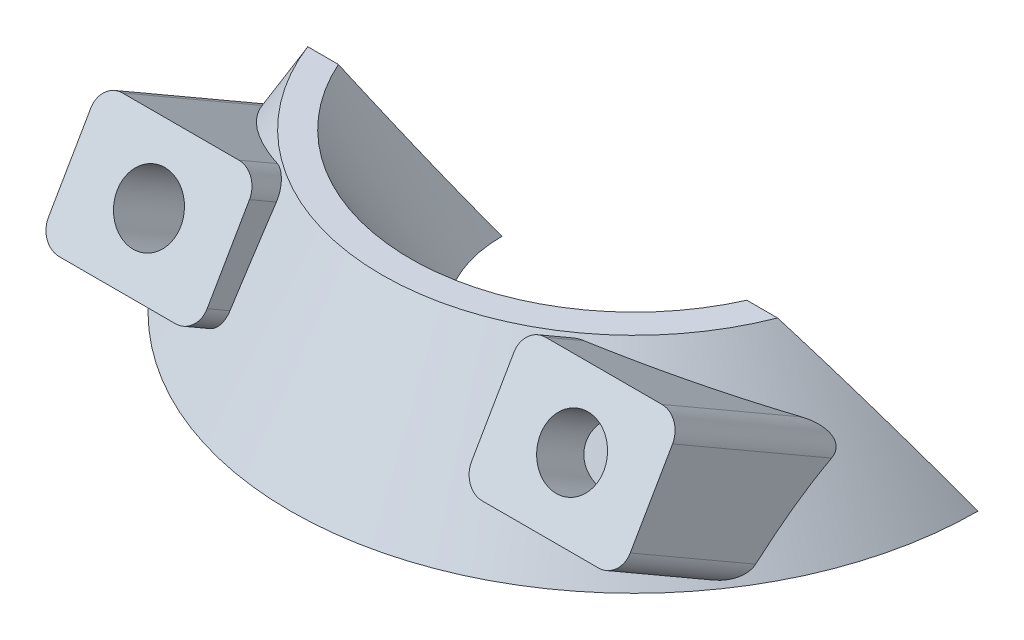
ISO-10303-21;
HEADER;
FILE_DESCRIPTION(('STEP AP214'),'2;1');
FILE_NAME('part.step','',(''),(''),'','','');
FILE_SCHEMA(('AUTOMOTIVE_DESIGN { 1 0 10303 214 1 1 1 1 }'));
ENDSEC;
DATA;
#1=APPLICATION_CONTEXT('core data for automotive mechanical design processes');
#2=APPLICATION_PROTOCOL_DEFINITION('international standard','automotive_design',2000,#1);
#3=PRODUCT_CONTEXT('',#1,'mechanical');
#4=PRODUCT('Part','Part','',(#3));
#5=PRODUCT_RELATED_PRODUCT_CATEGORY('part','',(#4));
#6=PRODUCT_DEFINITION_FORMATION('','',#4);
#7=PRODUCT_DEFINITION_CONTEXT('part definition',#1,'design');
#8=PRODUCT_DEFINITION('design','',#6,#7);
#9=PRODUCT_DEFINITION_SHAPE('','',#8);
#10=(LENGTH_UNIT() NAMED_UNIT(*) SI_UNIT(.MILLI.,.METRE.));
#11=(NAMED_UNIT(*) PLANE_ANGLE_UNIT() SI_UNIT($,.RADIAN.));
#12=(NAMED_UNIT(*) SI_UNIT($,.STERADIAN.) SOLID_ANGLE_UNIT());
#13=UNCERTAINTY_MEASURE_WITH_UNIT(LENGTH_MEASURE(1.E-05),#10,'distance_accuracy_value','');
#14=(GEOMETRIC_REPRESENTATION_CONTEXT(3) GLOBAL_UNCERTAINTY_ASSIGNED_CONTEXT((#13)) GLOBAL_UNIT_ASSIGNED_CONTEXT((#10,
#11,#12)) REPRESENTATION_CONTEXT('',''));
#15=CARTESIAN_POINT('',(0.,0.,0.));
#16=DIRECTION('',(0.,0.,1.));
#17=DIRECTION('',(1.,0.,0.));
#18=AXIS2_PLACEMENT_3D('',#15,#16,#17);
#19=CARTESIAN_POINT('',(0.,0.,0.));
#20=DIRECTION('',(0.,1.,0.));
#21=DIRECTION('',(0.,0.,-1.));
#22=AXIS2_PLACEMENT_3D('',#19,#20,#21);
#23=CONICAL_SURFACE('',#22,12.5,0.5235987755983);
#24=CARTESIAN_POINT('',(0.,0.,0.));
#25=DIRECTION('',(0.,-1.,0.));
#26=DIRECTION('',(0.,0.,-1.));
#27=AXIS2_PLACEMENT_3D('',#24,#25,#26);
#28=CIRCLE('',#27,12.5);
#29=CARTESIAN_POINT('',(12.5,0.,0.));
#30=VERTEX_POINT('',#29);
#31=CARTESIAN_POINT('',(-12.5,0.,0.));
#32=VERTEX_POINT('',#31);
#33=EDGE_CURVE('E471',#30,#32,#28,.T.);
#34=ORIENTED_EDGE('',*,*,#33,.T.);
#35=CARTESIAN_POINT('',(-19.3068990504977,15.,8.66025403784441));
#36=CARTESIAN_POINT('',(-19.0678016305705,14.3604446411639,8.2910065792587));
#37=CARTESIAN_POINT('',(-18.824738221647,13.7219887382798,7.92239389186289));
#38=CARTESIAN_POINT('',(-18.3297020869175,12.4476512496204,7.18665479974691));
#39=CARTESIAN_POINT('',(-18.0777290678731,11.8117697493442,6.8195284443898));
#40=CARTESIAN_POINT('',(-17.5642513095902,10.5438365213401,6.08748685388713));
#41=CARTESIAN_POINT('',(-17.3027595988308,9.91178084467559,5.72256933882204));
#42=CARTESIAN_POINT('',(-16.7687252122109,8.65116459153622,4.99475220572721));
#43=CARTESIAN_POINT('',(-16.496182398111,8.02260405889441,4.63185261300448));
#44=CARTESIAN_POINT('',(-15.9383525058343,6.76907707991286,3.90812847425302));
#45=CARTESIAN_POINT('',(-15.6530541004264,6.1441144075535,3.54730610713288));
#46=CARTESIAN_POINT('',(-15.0681800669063,4.8992416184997,2.82857846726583));
#47=CARTESIAN_POINT('',(-14.7686053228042,4.27933119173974,2.47067301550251));
#48=CARTESIAN_POINT('',(-14.3066499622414,3.3537033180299,1.93626151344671));
#49=CARTESIAN_POINT('',(-14.1504582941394,3.04566429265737,1.75841509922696));
#50=CARTESIAN_POINT('',(-13.8335907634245,2.43132290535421,1.40372493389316));
#51=CARTESIAN_POINT('',(-13.6729149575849,2.12502052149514,1.2268811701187));
#52=CARTESIAN_POINT('',(-13.3466700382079,1.51429442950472,0.8742782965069));
#53=CARTESIAN_POINT('',(-13.1810998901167,1.2098711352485,0.698519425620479));
#54=CARTESIAN_POINT('',(-12.8446455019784,0.603219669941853,0.348269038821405));
#55=CARTESIAN_POINT('',(-12.6737610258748,0.300991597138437,0.17377757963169));
#56=CARTESIAN_POINT('',(-12.5,0.,0.));
#57=B_SPLINE_CURVE_WITH_KNOTS('',3,(#35,#36,#37,#38,#39,#40,#41,#42,#43,#44,#45,#46,#47,#48,#49,
#50,#51,#52,#53,#54,#55,#56),.UNSPECIFIED.,.F.,.F.,(4,2,2,2,2,2,2,2,2,2,4),(0.,2.32871731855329,
4.65751135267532,6.98322964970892,9.30897704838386,11.6368324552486,13.9645439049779,
15.1299450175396,16.2953313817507,17.4609658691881,18.6266522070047),.UNSPECIFIED.);
#58=CARTESIAN_POINT('',(-19.3068990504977,15.,8.66025403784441));
#59=VERTEX_POINT('',#58);
#60=EDGE_CURVE('E293',#59,#32,#57,.T.);
#61=ORIENTED_EDGE('',*,*,#60,.F.);
#62=CARTESIAN_POINT('',(0.,15.,0.));
#63=DIRECTION('',(0.,-1.,0.));
#64=DIRECTION('',(0.,0.,-1.));
#65=AXIS2_PLACEMENT_3D('',#62,#63,#64);
#66=CIRCLE('',#65,21.1602540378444);
#67=CARTESIAN_POINT('',(19.3068990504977,15.,8.66025403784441));
#68=VERTEX_POINT('',#67);
#69=EDGE_CURVE('E318',#68,#59,#66,.T.);
#70=ORIENTED_EDGE('',*,*,#69,.F.);
#71=CARTESIAN_POINT('',(19.3068990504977,15.,8.66025403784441));
#72=CARTESIAN_POINT('',(19.0678016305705,14.3604446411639,8.29100657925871));
#73=CARTESIAN_POINT('',(18.824738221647,13.7219887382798,7.9223938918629));
#74=CARTESIAN_POINT('',(18.3297020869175,12.4476512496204,7.18665479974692));
#75=CARTESIAN_POINT('',(18.0777290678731,11.8117697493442,6.8195284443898));
#76=CARTESIAN_POINT('',(17.5642513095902,10.5438365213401,6.08748685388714));
#77=CARTESIAN_POINT('',(17.3027595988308,9.91178084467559,5.72256933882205));
#78=CARTESIAN_POINT('',(16.7687252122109,8.65116459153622,4.99475220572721));
#79=CARTESIAN_POINT('',(16.496182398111,8.02260405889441,4.63185261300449));
#80=CARTESIAN_POINT('',(15.9383525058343,6.76907707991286,3.90812847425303));
#81=CARTESIAN_POINT('',(15.6530541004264,6.14411440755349,3.54730610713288));
#82=CARTESIAN_POINT('',(15.0681800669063,4.8992416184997,2.82857846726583));
#83=CARTESIAN_POINT('',(14.7686053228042,4.27933119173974,2.47067301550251));
#84=CARTESIAN_POINT('',(14.3066499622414,3.3537033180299,1.93626151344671));
#85=CARTESIAN_POINT('',(14.1504582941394,3.04566429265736,1.75841509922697));
#86=CARTESIAN_POINT('',(13.8335907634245,2.43132290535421,1.40372493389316));
#87=CARTESIAN_POINT('',(13.6729149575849,2.12502052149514,1.22688117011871));
#88=CARTESIAN_POINT('',(13.3466700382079,1.51429442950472,0.874278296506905));
#89=CARTESIAN_POINT('',(13.1810998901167,1.2098711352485,0.698519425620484));
#90=CARTESIAN_POINT('',(12.8446455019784,0.603219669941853,0.34826903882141));
#91=CARTESIAN_POINT('',(12.6737610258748,0.300991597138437,0.173777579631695));
#92=CARTESIAN_POINT('',(12.5,0.,0.));
#93=B_SPLINE_CURVE_WITH_KNOTS('',3,(#71,#72,#73,#74,#75,#76,#77,#78,#79,#80,#81,#82,#83,#84,#85,
#86,#87,#88,#89,#90,#91,#92),.UNSPECIFIED.,.F.,.F.,(4,2,2,2,2,2,2,2,2,2,4),(0.,2.32871731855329,
4.65751135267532,6.98322964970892,9.30897704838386,11.6368324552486,13.9645439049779,
15.1299450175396,16.2953313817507,17.4609658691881,18.6266522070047),.UNSPECIFIED.);
#94=EDGE_CURVE('E299',#68,#30,#93,.T.);
#95=ORIENTED_EDGE('',*,*,#94,.T.);
#96=EDGE_LOOP('',(#34,#61,#70,#95));
#97=FACE_BOUND('',#96,.T.);
#98=ADVANCED_FACE('F33',(#97),#23,.F.);
#99=CARTESIAN_POINT('',(-12.5,0.,0.));
#100=DIRECTION('',(0.,0.500000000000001,-0.866025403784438));
#101=DIRECTION('',(0.,0.866025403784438,0.500000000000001));
#102=AXIS2_PLACEMENT_3D('',#99,#100,#101);
#103=PLANE('',#102);
#104=DIRECTION('',(-1.,0.,0.));
#105=VECTOR('',#104,1.);
#106=CARTESIAN_POINT('',(-12.5,0.,0.));
#107=LINE('',#106,#105);
#108=CARTESIAN_POINT('',(-32.5,0.,0.));
#109=VERTEX_POINT('',#108);
#110=EDGE_CURVE('E560',#32,#109,#107,.T.);
#111=ORIENTED_EDGE('',*,*,#110,.T.);
#112=CARTESIAN_POINT('',(-22.211111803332,15.,8.66025403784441));
#113=CARTESIAN_POINT('',(-22.4595582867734,14.7059020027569,8.49045647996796));
#114=CARTESIAN_POINT('',(-22.705292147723,14.4100971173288,8.31967344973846));
#115=CARTESIAN_POINT('',(-23.1916019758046,13.8153376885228,7.97628893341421));
#116=CARTESIAN_POINT('',(-23.4321781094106,13.5163832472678,7.80368750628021));
#117=CARTESIAN_POINT('',(-24.1465016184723,12.6152805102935,7.28343559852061));
#118=CARTESIAN_POINT('',(-24.6129410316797,12.0087776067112,6.93327098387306));
#119=CARTESIAN_POINT('',(-25.5274208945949,10.7869310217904,6.22783752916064));
#120=CARTESIAN_POINT('',(-25.9754908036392,10.1716038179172,5.87257820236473));
#121=CARTESIAN_POINT('',(-26.8557115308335,8.93243774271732,5.15714533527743));
#122=CARTESIAN_POINT('',(-27.2878615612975,8.30859845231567,4.79697155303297));
#123=CARTESIAN_POINT('',(-28.1373165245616,7.05402116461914,4.07264101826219));
#124=CARTESIAN_POINT('',(-28.5546322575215,6.42328864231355,3.7084874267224));
#125=CARTESIAN_POINT('',(-29.3759862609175,5.15538357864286,2.97646209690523));
#126=CARTESIAN_POINT('',(-29.7800245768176,4.51821105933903,2.60859037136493));
#127=CARTESIAN_POINT('',(-30.5765916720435,3.23709807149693,1.86893944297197));
#128=CARTESIAN_POINT('',(-30.9690996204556,2.59314790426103,1.49715464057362));
#129=CARTESIAN_POINT('',(-31.7427985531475,1.30020689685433,0.750674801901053));
#130=CARTESIAN_POINT('',(-32.123990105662,0.651216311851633,0.375979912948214));
#131=CARTESIAN_POINT('',(-32.5,0.,0.));
#132=B_SPLINE_CURVE_WITH_KNOTS('',3,(#112,#113,#114,#115,#116,#117,#118,#119,#120,#121,#122,
#123,#124,#125,#126,#127,#128,#129,#130,#131),.UNSPECIFIED.,.F.,.F.,(4,2,2,2,2,2,2,2,2,4),(0.,
1.26228932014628,2.52453783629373,5.04854130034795,7.56832459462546,10.0882323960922,
12.6062663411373,15.1242916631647,17.6466165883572,20.168814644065),.UNSPECIFIED.);
#133=CARTESIAN_POINT('',(-22.211111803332,15.,8.66025403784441));
#134=VERTEX_POINT('',#133);
#135=EDGE_CURVE('E312',#134,#109,#132,.T.);
#136=ORIENTED_EDGE('',*,*,#135,.F.);
#137=DIRECTION('',(1.,0.,0.));
#138=VECTOR('',#137,1.);
#139=CARTESIAN_POINT('',(0.,15.,8.66025403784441));
#140=LINE('',#139,#138);
#141=EDGE_CURVE('E321',#59,#134,#140,.F.);
#142=ORIENTED_EDGE('',*,*,#141,.F.);
#143=ORIENTED_EDGE('',*,*,#60,.T.);
#144=EDGE_LOOP('',(#111,#136,#142,#143));
#145=FACE_BOUND('',#144,.T.);
#146=ADVANCED_FACE('F277',(#145),#103,.T.);
#147=CARTESIAN_POINT('',(0.,0.,0.));
#148=DIRECTION('',(0.,-1.,0.));
#149=DIRECTION('',(0.,0.,-1.));
#150=AXIS2_PLACEMENT_3D('',#147,#148,#149);
#151=CONICAL_SURFACE('',#150,32.5,0.5235987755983);
#152=CARTESIAN_POINT('',(0.,-3.13934208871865,-11.4375000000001));
#153=DIRECTION('',(0.,0.866025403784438,-0.500000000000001));
#154=DIRECTION('',(0.,-0.500000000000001,-0.866025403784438));
#155=AXIS2_PLACEMENT_3D('',#152,#153,#154);
#156=ELLIPSE('',#155,39.6206622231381,32.3501352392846);
#157=CARTESIAN_POINT('',(-14.5,14.5695672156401,19.2352306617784));
#158=VERTEX_POINT('',#157);
#159=CARTESIAN_POINT('',(-25.5,9.0510421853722,9.67686492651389));
#160=VERTEX_POINT('',#159);
#161=EDGE_CURVE('E198',#158,#160,#156,.F.);
#162=ORIENTED_EDGE('',*,*,#161,.F.);
#163=CARTESIAN_POINT('',(-14.5001999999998,11.2917389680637,21.5578655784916));
#164=CARTESIAN_POINT('',(-14.4406974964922,11.3082229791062,21.5864197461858));
#165=CARTESIAN_POINT('',(-14.3810167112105,11.3268145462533,21.6133276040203));
#166=CARTESIAN_POINT('',(-14.2616252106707,11.3682380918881,21.6636664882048));
#167=CARTESIAN_POINT('',(-14.2019144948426,11.3910721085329,21.6870958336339));
#168=CARTESIAN_POINT('',(-14.0228322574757,11.4661510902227,21.7520252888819));
#169=CARTESIAN_POINT('',(-13.9039985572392,11.5248398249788,21.7879321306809));
#170=CARTESIAN_POINT('',(-13.6715472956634,11.6590082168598,21.8432122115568));
#171=CARTESIAN_POINT('',(-13.5579477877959,11.7345414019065,21.8625317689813));
#172=CARTESIAN_POINT('',(-13.3410629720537,11.9010204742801,21.8830593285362));
#173=CARTESIAN_POINT('',(-13.2377553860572,11.9919318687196,21.884307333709));
#174=CARTESIAN_POINT('',(-13.0556293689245,12.1774560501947,21.8687656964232));
#175=CARTESIAN_POINT('',(-12.9754028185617,12.2708312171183,21.8537332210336));
#176=CARTESIAN_POINT('',(-12.8309026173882,12.465902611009,21.8083152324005));
#177=CARTESIAN_POINT('',(-12.7666226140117,12.5675955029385,21.7779358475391));
#178=CARTESIAN_POINT('',(-12.6634204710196,12.7642502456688,21.7067567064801));
#179=CARTESIAN_POINT('',(-12.622477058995,12.8587083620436,21.6674856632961));
#180=CARTESIAN_POINT('',(-12.5576005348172,13.0485008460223,21.5784629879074));
#181=CARTESIAN_POINT('',(-12.53365724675,13.1438346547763,21.5287176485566));
#182=CARTESIAN_POINT('',(-12.5047337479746,13.3258511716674,21.4239381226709));
#183=CARTESIAN_POINT('',(-12.4985882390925,13.4126849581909,21.3694833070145));
#184=CARTESIAN_POINT('',(-12.5019559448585,13.5817725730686,21.2543314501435));
#185=CARTESIAN_POINT('',(-12.5114675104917,13.6640268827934,21.1936350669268));
#186=CARTESIAN_POINT('',(-12.5453549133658,13.8210029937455,21.068179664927));
#187=CARTESIAN_POINT('',(-12.569613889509,13.8957786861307,21.0034561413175));
#188=CARTESIAN_POINT('',(-12.6316698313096,14.0366711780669,20.8711692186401));
#189=CARTESIAN_POINT('',(-12.6694689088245,14.1027866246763,20.803605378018));
#190=CARTESIAN_POINT('',(-12.7591821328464,14.2280391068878,20.6637753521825));
#191=CARTESIAN_POINT('',(-12.8117067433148,14.2866629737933,20.5914428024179));
#192=CARTESIAN_POINT('',(-12.9278021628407,14.3918698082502,20.44692714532));
#193=CARTESIAN_POINT('',(-12.9913762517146,14.4384491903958,20.3747440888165));
#194=CARTESIAN_POINT('',(-13.1340768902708,14.5230309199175,20.2248926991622));
#195=CARTESIAN_POINT('',(-13.2141149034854,14.5597572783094,20.147374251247));
#196=CARTESIAN_POINT('',(-13.382318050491,14.6181054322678,19.9955232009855));
#197=CARTESIAN_POINT('',(-13.4704886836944,14.6397169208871,19.9211928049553));
#198=CARTESIAN_POINT('',(-13.6640290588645,14.6699262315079,19.7678350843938));
#199=CARTESIAN_POINT('',(-13.7701676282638,14.6765469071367,19.6893917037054));
#200=CARTESIAN_POINT('',(-13.9868019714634,14.6717766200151,19.5394821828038));
#201=CARTESIAN_POINT('',(-14.0972958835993,14.6603932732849,19.4680131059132));
#202=CARTESIAN_POINT('',(-14.2570675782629,14.6318137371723,19.371454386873));
#203=CARTESIAN_POINT('',(-14.3056485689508,14.6215390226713,19.3429812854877));
#204=CARTESIAN_POINT('',(-14.4028821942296,14.5978538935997,19.2877586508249));
#205=CARTESIAN_POINT('',(-14.4515344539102,14.5844502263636,19.261005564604));
#206=CARTESIAN_POINT('',(-14.5002,14.5695057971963,19.2351243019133));
#207=B_SPLINE_CURVE_WITH_KNOTS('',3,(#163,#164,#165,#166,#167,#168,#169,#170,#171,#172,#173,
#174,#175,#176,#177,#178,#179,#180,#181,#182,#183,#184,#185,#186,#187,#188,#189,#190,#191,#192,
#193,#194,#195,#196,#197,#198,#199,#200,#201,#202,#203,#204,#205,#206),.UNSPECIFIED.,.F.,.F.,(4,
2,2,2,2,2,2,2,2,2,2,2,2,2,2,2,2,2,2,2,2,4),(0.,0.203972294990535,0.408042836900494,
0.817836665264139,1.22895176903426,1.63915669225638,2.00912779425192,2.37895127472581,
2.70777289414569,3.0363975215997,3.34295728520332,3.64948476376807,3.95361436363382,
4.25779141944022,4.57715403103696,4.8966116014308,5.24716077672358,5.59794876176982,
5.99282806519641,6.38754037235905,6.55916901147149,6.7304309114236),.UNSPECIFIED.);
#208=CARTESIAN_POINT('',(-12.5,13.4698191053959,21.3304110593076));
#209=VERTEX_POINT('',#208);
#210=EDGE_CURVE('E179',#209,#158,#207,.T.);
#211=ORIENTED_EDGE('',*,*,#210,.F.);
#212=CARTESIAN_POINT('',(-12.5,-28.3034896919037,47.2143617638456));
#213=CARTESIAN_POINT('',(-12.5,-26.8997654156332,46.3759765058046));
#214=CARTESIAN_POINT('',(-12.5,-25.4966649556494,45.5365448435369));
#215=CARTESIAN_POINT('',(-12.5,-22.6919821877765,43.8551396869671));
#216=CARTESIAN_POINT('',(-12.5,-21.2903998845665,43.0131661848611));
#217=CARTESIAN_POINT('',(-12.5,-18.4889279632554,41.3261704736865));
#218=CARTESIAN_POINT('',(-12.5,-17.0890384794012,40.4811480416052));
#219=CARTESIAN_POINT('',(-12.5,-14.2914281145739,38.787523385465));
#220=CARTESIAN_POINT('',(-12.5,-12.8937072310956,37.938921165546));
#221=CARTESIAN_POINT('',(-12.5,-10.0958326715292,36.2342896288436));
#222=CARTESIAN_POINT('',(-12.5,-8.69568860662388,35.3782445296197));
#223=CARTESIAN_POINT('',(-12.5,-5.89869604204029,33.6607881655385));
#224=CARTESIAN_POINT('',(-12.5,-4.50184753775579,32.7993769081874));
#225=CARTESIAN_POINT('',(-12.5,-1.71232646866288,31.0698656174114));
#226=CARTESIAN_POINT('',(-12.5,-0.319653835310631,30.2017656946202));
#227=CARTESIAN_POINT('',(-12.5,2.46034379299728,28.4570519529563));
#228=CARTESIAN_POINT('',(-12.5,3.8476688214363,27.5804381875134));
#229=CARTESIAN_POINT('',(-12.5,6.28956195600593,26.0237319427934));
#230=CARTESIAN_POINT('',(-12.5,7.3455987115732,25.3459450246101));
#231=CARTESIAN_POINT('',(-12.5,9.45239507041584,23.9822935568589));
#232=CARTESIAN_POINT('',(-12.5,10.5031548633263,23.2964293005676));
#233=CARTESIAN_POINT('',(-12.5,12.5966778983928,21.9152629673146));
#234=CARTESIAN_POINT('',(-12.5,13.6394491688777,21.2199730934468));
#235=CARTESIAN_POINT('',(-12.5,15.1969305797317,20.1670150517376));
#236=CARTESIAN_POINT('',(-12.5,15.7150133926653,19.8143342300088));
#237=CARTESIAN_POINT('',(-12.5,16.7485407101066,19.1051299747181));
#238=CARTESIAN_POINT('',(-12.5,17.2639852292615,18.7486065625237));
#239=CARTESIAN_POINT('',(-12.5,18.2842415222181,18.0363673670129));
#240=CARTESIAN_POINT('',(-12.5,18.7890984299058,17.6807162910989));
#241=CARTESIAN_POINT('',(-12.5,19.7952261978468,16.9643830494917));
#242=CARTESIAN_POINT('',(-12.5,20.2964970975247,16.6037009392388));
#243=CARTESIAN_POINT('',(-12.5,21.2945592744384,15.8765443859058));
#244=CARTESIAN_POINT('',(-12.5,21.7913520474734,15.5100719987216));
#245=CARTESIAN_POINT('',(-12.5,22.7797125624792,14.7700892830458));
#246=CARTESIAN_POINT('',(-12.5,23.2712800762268,14.396578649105));
#247=CARTESIAN_POINT('',(-12.5,24.2489534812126,13.6403193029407));
#248=CARTESIAN_POINT('',(-12.5,24.7350454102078,13.2575525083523));
#249=CARTESIAN_POINT('',(-12.5,25.6989273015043,12.4817766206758));
#250=CARTESIAN_POINT('',(-12.5,26.1767182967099,12.0887688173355));
#251=CARTESIAN_POINT('',(-12.5,26.8856481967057,11.4895124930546));
#252=CARTESIAN_POINT('',(-12.5,27.1208044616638,11.288012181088));
#253=CARTESIAN_POINT('',(-12.5,27.5880147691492,10.8814549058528));
#254=CARTESIAN_POINT('',(-12.5,27.8200689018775,10.6763980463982));
#255=CARTESIAN_POINT('',(-12.5,28.2807004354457,10.2622150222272));
#256=CARTESIAN_POINT('',(-12.5,28.5092763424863,10.0530871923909));
#257=CARTESIAN_POINT('',(-12.5,28.9622465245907,9.6303089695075));
#258=CARTESIAN_POINT('',(-12.5,29.1866403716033,9.41665811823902));
#259=CARTESIAN_POINT('',(-12.5,29.4086169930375,9.20049873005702));
#260=B_SPLINE_CURVE_WITH_KNOTS('',3,(#212,#213,#214,#215,#216,#217,#218,#219,#220,#221,#222,
#223,#224,#225,#226,#227,#228,#229,#230,#231,#232,#233,#234,#235,#236,#237,#238,#239,#240,#241,
#242,#243,#244,#245,#246,#247,#248,#249,#250,#251,#252,#253,#254,#255,#256,#257,#258,#259),
.UNSPECIFIED.,.F.,.F.,(4,2,2,2,2,2,2,2,2,2,2,2,2,2,2,2,2,2,2,2,2,2,2,4),(0.,4.90509890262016,
9.81021287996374,14.7156932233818,19.6211678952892,24.5444650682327,29.4677553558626,
34.3909643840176,39.3141425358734,43.0786156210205,46.8429524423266,50.6028094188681,
52.4829930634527,54.3631662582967,56.2157907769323,58.0683948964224,59.9203553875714,
61.7723964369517,63.6284065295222,65.484183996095,66.4131906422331,67.3421702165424,
68.2715380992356,69.2010005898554),.UNSPECIFIED.);
#261=CARTESIAN_POINT('',(-12.5,6.76499171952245,25.7173093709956));
#262=VERTEX_POINT('',#261);
#263=EDGE_CURVE('E187',#262,#209,#260,.T.);
#264=ORIENTED_EDGE('',*,*,#263,.F.);
#265=CARTESIAN_POINT('',(-14.5002,4.64907584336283,26.0524355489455));
#266=CARTESIAN_POINT('',(-14.441536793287,4.66271942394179,26.0760721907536));
#267=CARTESIAN_POINT('',(-14.3827636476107,4.67844619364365,26.0981644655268));
#268=CARTESIAN_POINT('',(-14.2653301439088,4.7140611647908,26.1391158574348));
#269=CARTESIAN_POINT('',(-14.2066698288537,4.73395071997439,26.1579739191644));
#270=CARTESIAN_POINT('',(-14.0311574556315,4.79993761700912,26.2095340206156));
#271=CARTESIAN_POINT('',(-13.9150358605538,4.85229295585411,26.2371163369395));
#272=CARTESIAN_POINT('',(-13.6883788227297,4.97307972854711,26.2774741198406));
#273=CARTESIAN_POINT('',(-13.5778572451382,5.04154890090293,26.2902144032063));
#274=CARTESIAN_POINT('',(-13.3667834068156,5.19319981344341,26.2999794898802));
#275=CARTESIAN_POINT('',(-13.2662161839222,5.27635893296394,26.297028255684));
#276=CARTESIAN_POINT('',(-13.0854438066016,5.44935232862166,26.2759020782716));
#277=CARTESIAN_POINT('',(-13.0043213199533,5.53835422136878,26.2587707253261));
#278=CARTESIAN_POINT('',(-12.8575741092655,5.72511215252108,26.2108912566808));
#279=CARTESIAN_POINT('',(-12.7919464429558,5.82286652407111,26.1801457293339));
#280=CARTESIAN_POINT('',(-12.6837489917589,6.01583321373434,26.1089284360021));
#281=CARTESIAN_POINT('',(-12.6397384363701,6.1106061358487,26.0694505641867));
#282=CARTESIAN_POINT('',(-12.5690601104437,6.30207332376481,25.9808556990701));
#283=CARTESIAN_POINT('',(-12.5423839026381,6.398766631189,25.931743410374));
#284=CARTESIAN_POINT('',(-12.508316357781,6.58593989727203,25.8281753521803));
#285=CARTESIAN_POINT('',(-12.4999885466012,6.67648013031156,25.7741339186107));
#286=CARTESIAN_POINT('',(-12.5000114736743,6.85384279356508,25.6602668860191));
#287=CARTESIAN_POINT('',(-12.5083617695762,6.94066532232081,25.6004414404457));
#288=CARTESIAN_POINT('',(-12.5410698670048,7.10717771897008,25.4773250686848));
#289=CARTESIAN_POINT('',(-12.5652581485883,7.18693307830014,25.4140772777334));
#290=CARTESIAN_POINT('',(-12.6283856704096,7.33819126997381,25.2851904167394));
#291=CARTESIAN_POINT('',(-12.6673225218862,7.40969543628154,25.219551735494));
#292=CARTESIAN_POINT('',(-12.7598655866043,7.54489275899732,25.0853194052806));
#293=CARTESIAN_POINT('',(-12.8138991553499,7.60826496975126,25.0166981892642));
#294=CARTESIAN_POINT('',(-12.934086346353,7.72315722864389,24.8800349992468));
#295=CARTESIAN_POINT('',(-13.0002520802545,7.77466531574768,24.8119936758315));
#296=CARTESIAN_POINT('',(-13.1415261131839,7.86429114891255,24.6788422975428));
#297=CARTESIAN_POINT('',(-13.2164992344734,7.90258294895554,24.6137048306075));
#298=CARTESIAN_POINT('',(-13.3738783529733,7.96636860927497,24.4866045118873));
#299=CARTESIAN_POINT('',(-13.4562665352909,7.99189222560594,24.4246345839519));
#300=CARTESIAN_POINT('',(-13.5414372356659,8.01093498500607,24.3647012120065));
#301=B_SPLINE_CURVE_WITH_KNOTS('',3,(#265,#266,#267,#268,#269,#270,#271,#272,#273,#274,#275,
#276,#277,#278,#279,#280,#281,#282,#283,#284,#285,#286,#287,#288,#289,#290,#291,#292,#293,#294,
#295,#296,#297,#298,#299,#300),.UNSPECIFIED.,.F.,.F.,(4,2,2,2,2,2,2,2,2,2,2,2,2,2,2,2,2,4),(0.,
0.193996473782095,0.388056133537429,0.777031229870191,1.16692653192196,1.55622659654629,
1.91918552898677,2.28207548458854,2.61546414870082,2.94869041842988,3.26447193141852,
3.58024506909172,3.89269243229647,4.20508921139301,4.52742646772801,4.8500872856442,
5.16832027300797,5.48580812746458),.UNSPECIFIED.);
#302=CARTESIAN_POINT('',(-14.5,4.64912235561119,26.0525161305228));
#303=VERTEX_POINT('',#302);
#304=EDGE_CURVE('E186',#303,#262,#301,.T.);
#305=ORIENTED_EDGE('',*,*,#304,.F.);
#306=CARTESIAN_POINT('',(0.,-18.7277993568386,-14.4375000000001));
#307=DIRECTION('',(0.,-0.866025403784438,0.500000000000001));
#308=DIRECTION('',(0.,-0.500000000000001,-0.866025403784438));
#309=AXIS2_PLACEMENT_3D('',#306,#307,#308);
#310=ELLIPSE('',#309,50.0129670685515,40.8354166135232);
#311=CARTESIAN_POINT('',(-25.5,0.803725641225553,19.3920936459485));
#312=VERTEX_POINT('',#311);
#313=EDGE_CURVE('E485',#312,#303,#310,.F.);
#314=ORIENTED_EDGE('',*,*,#313,.F.);
#315=CARTESIAN_POINT('',(-25.4998,3.72695363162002,16.4552730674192));
#316=CARTESIAN_POINT('',(-25.5760368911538,3.6846935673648,16.382141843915));
#317=CARTESIAN_POINT('',(-25.6525974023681,3.63884064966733,16.3113512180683));
#318=CARTESIAN_POINT('',(-25.8062459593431,3.53974828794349,16.1751380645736));
#319=CARTESIAN_POINT('',(-25.8833349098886,3.48648554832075,16.1097335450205));
#320=CARTESIAN_POINT('',(-26.0385142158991,3.37183957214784,15.9845836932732));
#321=CARTESIAN_POINT('',(-26.1166033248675,3.31035219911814,15.9249314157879));
#322=CARTESIAN_POINT('',(-26.272059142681,3.17975991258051,15.8138418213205));
#323=CARTESIAN_POINT('',(-26.3494267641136,3.11066663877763,15.7623922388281));
#324=CARTESIAN_POINT('',(-26.5030553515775,2.96429823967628,15.6693930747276));
#325=CARTESIAN_POINT('',(-26.5793116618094,2.88699610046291,15.6278777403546));
#326=CARTESIAN_POINT('',(-26.7289736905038,2.72445625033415,15.5578928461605));
#327=CARTESIAN_POINT('',(-26.802388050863,2.63924580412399,15.5293803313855));
#328=CARTESIAN_POINT('',(-26.9309605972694,2.47794340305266,15.4929101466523));
#329=CARTESIAN_POINT('',(-26.986943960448,2.40317867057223,15.4820832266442));
#330=CARTESIAN_POINT('',(-27.0938876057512,2.24936414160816,15.4740139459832));
#331=CARTESIAN_POINT('',(-27.1448545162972,2.17032021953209,15.4767534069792));
#332=CARTESIAN_POINT('',(-27.2293672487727,2.02659979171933,15.4960301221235));
#333=CARTESIAN_POINT('',(-27.2643296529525,1.9623642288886,15.5095711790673));
#334=CARTESIAN_POINT('',(-27.3280429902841,1.8339902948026,15.5474655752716));
#335=CARTESIAN_POINT('',(-27.3567989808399,1.76985188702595,15.5718100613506));
#336=CARTESIAN_POINT('',(-27.4069183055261,1.64340947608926,15.6313077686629));
#337=CARTESIAN_POINT('',(-27.4282561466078,1.58111245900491,15.6664974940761));
#338=CARTESIAN_POINT('',(-27.4626885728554,1.46053921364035,15.7464819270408));
#339=CARTESIAN_POINT('',(-27.4757806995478,1.40226418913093,15.7912794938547));
#340=CARTESIAN_POINT('',(-27.4933683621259,1.29360216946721,15.886402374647));
#341=CARTESIAN_POINT('',(-27.498214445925,1.24298180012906,15.9364007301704));
#342=CARTESIAN_POINT('',(-27.5009643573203,1.14729438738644,16.0415814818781));
#343=CARTESIAN_POINT('',(-27.498865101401,1.10222981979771,16.0967661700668));
#344=CARTESIAN_POINT('',(-27.4857512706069,0.99542784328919,16.240805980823));
#345=CARTESIAN_POINT('',(-27.470617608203,0.937436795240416,16.3320653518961));
#346=CARTESIAN_POINT('',(-27.4287438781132,0.833638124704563,16.5187596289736));
#347=CARTESIAN_POINT('',(-27.4019742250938,0.787862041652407,16.6142046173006));
#348=CARTESIAN_POINT('',(-27.3238973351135,0.687576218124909,16.8531975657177));
#349=CARTESIAN_POINT('',(-27.2669859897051,0.639591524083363,16.9976329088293));
#350=CARTESIAN_POINT('',(-27.1378614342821,0.563571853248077,17.2848850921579));
#351=CARTESIAN_POINT('',(-27.0656169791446,0.535578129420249,17.4276979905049));
#352=CARTESIAN_POINT('',(-26.9333052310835,0.502931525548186,17.6654983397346));
#353=CARTESIAN_POINT('',(-26.8763547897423,0.493742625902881,17.7616508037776));
#354=CARTESIAN_POINT('',(-26.7574625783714,0.483112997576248,17.9512781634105));
#355=CARTESIAN_POINT('',(-26.6955188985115,0.481675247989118,18.0447520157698));
#356=CARTESIAN_POINT('',(-26.5031896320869,0.488385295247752,18.3202719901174));
#357=CARTESIAN_POINT('',(-26.3661957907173,0.507531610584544,18.4976118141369));
#358=CARTESIAN_POINT('',(-26.1090450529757,0.566929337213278,18.799730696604));
#359=CARTESIAN_POINT('',(-25.9913873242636,0.601908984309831,18.9277303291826));
#360=CARTESIAN_POINT('',(-25.8101755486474,0.667615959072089,19.1098516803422));
#361=CARTESIAN_POINT('',(-25.7490576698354,0.691688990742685,19.1688497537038));
#362=CARTESIAN_POINT('',(-25.6254176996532,0.744348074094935,19.2833042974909));
#363=CARTESIAN_POINT('',(-25.5628950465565,0.772935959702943,19.3387593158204));
#364=CARTESIAN_POINT('',(-25.4998,0.803823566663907,19.3922632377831));
#365=B_SPLINE_CURVE_WITH_KNOTS('',3,(#315,#316,#317,#318,#319,#320,#321,#322,#323,#324,#325,
#326,#327,#328,#329,#330,#331,#332,#333,#334,#335,#336,#337,#338,#339,#340,#341,#342,#343,#344,
#345,#346,#347,#348,#349,#350,#351,#352,#353,#354,#355,#356,#357,#358,#359,#360,#361,#362,#363,
#364),.UNSPECIFIED.,.F.,.F.,(4,2,2,2,2,2,2,2,2,2,2,2,2,2,2,2,2,2,2,2,2,2,2,2,4),(0.,
0.341331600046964,0.683761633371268,1.03103165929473,1.37777744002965,1.72570190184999,
2.0724685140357,2.3535940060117,2.63434290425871,2.85655064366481,3.0785766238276,
3.30135824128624,3.52420625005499,3.73731942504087,3.9505272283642,4.27621448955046,
4.60273472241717,5.08755492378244,5.57337272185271,5.90934814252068,6.24545268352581,
6.9169933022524,7.4476177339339,7.71231695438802,7.97712397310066),.UNSPECIFIED.);
#366=CARTESIAN_POINT('',(-27.5,1.16674958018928,16.0208695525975));
#367=VERTEX_POINT('',#366);
#368=EDGE_CURVE('E231',#367,#312,#365,.T.);
#369=ORIENTED_EDGE('',*,*,#368,.F.);
#370=CARTESIAN_POINT('',(-27.5,-19.0156634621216,33.677102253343));
#371=CARTESIAN_POINT('',(-27.5,-18.3171693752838,33.1564129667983));
#372=CARTESIAN_POINT('',(-27.5,-17.6209416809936,32.6326628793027));
#373=CARTESIAN_POINT('',(-27.5,-16.2337555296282,31.5781559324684));
#374=CARTESIAN_POINT('',(-27.5,-15.5427973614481,31.0473986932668));
#375=CARTESIAN_POINT('',(-27.5,-14.166034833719,29.977327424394));
#376=CARTESIAN_POINT('',(-27.5,-13.4802386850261,29.4380028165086));
#377=CARTESIAN_POINT('',(-27.5,-12.1157505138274,28.3504523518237));
#378=CARTESIAN_POINT('',(-27.5,-11.4370583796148,27.8022266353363));
#379=CARTESIAN_POINT('',(-27.5,-10.0737742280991,26.6839712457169));
#380=CARTESIAN_POINT('',(-27.5,-9.38935913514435,26.1137255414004));
#381=CARTESIAN_POINT('',(-27.5,-8.03083656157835,24.9610873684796));
#382=CARTESIAN_POINT('',(-27.5,-7.35672888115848,24.3786951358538));
#383=CARTESIAN_POINT('',(-27.5,-6.02123714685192,23.2001557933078));
#384=CARTESIAN_POINT('',(-27.5,-5.35984675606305,22.6040158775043));
#385=CARTESIAN_POINT('',(-27.5,-4.05214636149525,21.3954240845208));
#386=CARTESIAN_POINT('',(-27.5,-3.40583545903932,20.7829731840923));
#387=CARTESIAN_POINT('',(-27.5,-2.39914273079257,19.799941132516));
#388=CARTESIAN_POINT('',(-27.5,-2.03256972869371,19.4356941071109));
#389=CARTESIAN_POINT('',(-27.5,-1.30660562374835,18.7001196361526));
#390=CARTESIAN_POINT('',(-27.5,-0.947214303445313,18.3287924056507));
#391=CARTESIAN_POINT('',(-27.5,-0.236523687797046,17.5782148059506));
#392=CARTESIAN_POINT('',(-27.5,0.114772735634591,17.1989617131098));
#393=CARTESIAN_POINT('',(-27.5,0.807892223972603,16.4318672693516));
#394=CARTESIAN_POINT('',(-27.5,1.14971514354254,16.0440257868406));
#395=CARTESIAN_POINT('',(-27.5,1.82099672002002,15.2605001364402));
#396=CARTESIAN_POINT('',(-27.5,2.15050006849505,14.8648543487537));
#397=CARTESIAN_POINT('',(-27.5,2.79677778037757,14.0632968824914));
#398=CARTESIAN_POINT('',(-27.5,3.11355263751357,13.6573856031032));
#399=CARTESIAN_POINT('',(-27.5,3.73198141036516,12.8345985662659));
#400=CARTESIAN_POINT('',(-27.5,4.03364553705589,12.4177305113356));
#401=CARTESIAN_POINT('',(-27.5,4.61947258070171,11.5717340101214));
#402=CARTESIAN_POINT('',(-27.5,4.90363265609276,11.1426035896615));
#403=CARTESIAN_POINT('',(-27.5,5.48508866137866,10.2173278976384));
#404=CARTESIAN_POINT('',(-27.5,5.77966196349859,9.7194589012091));
#405=CARTESIAN_POINT('',(-27.5,6.33706160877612,8.70636971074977));
#406=CARTESIAN_POINT('',(-27.5,6.59989973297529,8.19115604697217));
#407=CARTESIAN_POINT('',(-27.5,7.08719389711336,7.14355543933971));
#408=CARTESIAN_POINT('',(-27.5,7.31169970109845,6.61119184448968));
#409=CARTESIAN_POINT('',(-27.5,7.71551275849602,5.52952069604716));
#410=CARTESIAN_POINT('',(-27.5,7.894831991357,4.98021767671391));
#411=CARTESIAN_POINT('',(-27.5,8.17366441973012,3.96660033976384));
#412=CARTESIAN_POINT('',(-27.5,8.28171239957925,3.50463818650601));
#413=CARTESIAN_POINT('',(-27.5,8.45888999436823,2.57327708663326));
#414=CARTESIAN_POINT('',(-27.5,8.52802428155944,2.10387903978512));
#415=CARTESIAN_POINT('',(-27.5,8.62471246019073,1.16174406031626));
#416=CARTESIAN_POINT('',(-27.5,8.65235051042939,0.68901584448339));
#417=CARTESIAN_POINT('',(-27.5,8.6652192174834,-0.25702854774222));
#418=CARTESIAN_POINT('',(-27.5,8.65044959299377,-0.730344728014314));
#419=CARTESIAN_POINT('',(-27.5,8.5792251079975,-1.67203886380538));
#420=CARTESIAN_POINT('',(-27.5,8.52292422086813,-2.14042859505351));
#421=CARTESIAN_POINT('',(-27.5,8.37093950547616,-3.07073542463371));
#422=CARTESIAN_POINT('',(-27.5,8.27525338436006,-3.53265214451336));
#423=CARTESIAN_POINT('',(-27.5,8.04699582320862,-4.45046357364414));
#424=CARTESIAN_POINT('',(-27.5,7.91418379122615,-4.90629796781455));
#425=CARTESIAN_POINT('',(-27.5,7.61591143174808,-5.80701215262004));
#426=CARTESIAN_POINT('',(-27.5,7.45045268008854,-6.2518924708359));
#427=CARTESIAN_POINT('',(-27.5,6.97058352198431,-7.4238193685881));
#428=CARTESIAN_POINT('',(-27.5,6.63060069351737,-8.14042319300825));
#429=CARTESIAN_POINT('',(-27.5,5.88805458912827,-9.5413341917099));
#430=CARTESIAN_POINT('',(-27.5,5.48538704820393,-10.2255850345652));
#431=CARTESIAN_POINT('',(-27.5,4.84961851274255,-11.2221597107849));
#432=CARTESIAN_POINT('',(-27.5,4.63469728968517,-11.5462942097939));
#433=CARTESIAN_POINT('',(-27.5,4.19461385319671,-12.1875825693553));
#434=CARTESIAN_POINT('',(-27.5,3.96945096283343,-12.5047359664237));
#435=CARTESIAN_POINT('',(-27.5,3.51104854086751,-13.1311711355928));
#436=CARTESIAN_POINT('',(-27.5,3.2778450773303,-13.4404794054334));
#437=CARTESIAN_POINT('',(-27.5,2.80355960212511,-14.0528788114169));
#438=CARTESIAN_POINT('',(-27.5,2.56247955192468,-14.355971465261));
#439=CARTESIAN_POINT('',(-27.5,2.31792735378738,-14.6562031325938));
#440=B_SPLINE_CURVE_WITH_KNOTS('',3,(#370,#371,#372,#373,#374,#375,#376,#377,#378,#379,#380,
#381,#382,#383,#384,#385,#386,#387,#388,#389,#390,#391,#392,#393,#394,#395,#396,#397,#398,#399,
#400,#401,#402,#403,#404,#405,#406,#407,#408,#409,#410,#411,#412,#413,#414,#415,#416,#417,#418,
#419,#420,#421,#422,#423,#424,#425,#426,#427,#428,#429,#430,#431,#432,#433,#434,#435,#436,#437,
#438,#439),.UNSPECIFIED.,.F.,.F.,(4,2,2,2,2,2,2,2,2,2,2,2,2,2,2,2,2,2,2,2,2,2,2,2,2,2,2,2,2,2,2,
2,2,2,4),(0.,2.61364752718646,5.22743732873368,7.84475349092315,10.4620284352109,
13.1344416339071,15.8068029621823,18.4777962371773,21.1486299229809,22.6988601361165,
24.2490433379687,25.7997683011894,27.3505170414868,28.8949491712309,30.4393213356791,
31.9826354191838,33.5261993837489,35.2606861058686,36.9945269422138,38.7260994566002,
40.4572124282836,41.8790008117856,43.30061844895,44.7193489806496,46.1380889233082,
47.5515952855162,48.9651839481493,50.3881545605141,51.8110565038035,54.1863382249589,
56.5656138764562,57.7322004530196,58.8988642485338,60.0608426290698,61.2225338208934),.UNSPECIFIED.);
#441=CARTESIAN_POINT('',(-27.5000000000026,6.2591632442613,8.84118875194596));
#442=VERTEX_POINT('',#441);
#443=EDGE_CURVE('E237',#442,#367,#440,.F.);
#444=ORIENTED_EDGE('',*,*,#443,.F.);
#445=CARTESIAN_POINT('',(-24.2319154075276,9.69075385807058,11.6916845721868));
#446=CARTESIAN_POINT('',(-24.2690659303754,9.68549544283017,11.6216749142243));
#447=CARTESIAN_POINT('',(-24.3067591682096,9.67844720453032,11.5521109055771));
#448=CARTESIAN_POINT('',(-24.3830645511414,9.66101004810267,11.4139355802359));
#449=CARTESIAN_POINT('',(-24.4216764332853,9.65062207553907,11.3453239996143));
#450=CARTESIAN_POINT('',(-24.5386039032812,9.61482171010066,11.1410706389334));
#451=CARTESIAN_POINT('',(-24.6180771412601,9.58476279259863,11.0068870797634));
#452=CARTESIAN_POINT('',(-24.778279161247,9.51407082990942,10.7443265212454));
#453=CARTESIAN_POINT('',(-24.8589840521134,9.47355946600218,10.6159014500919));
#454=CARTESIAN_POINT('',(-25.0219756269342,9.3827431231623,10.3636131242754));
#455=CARTESIAN_POINT('',(-25.1042621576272,9.33243908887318,10.2397494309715));
#456=CARTESIAN_POINT('',(-25.2387483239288,9.24338395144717,10.0429103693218));
#457=CARTESIAN_POINT('',(-25.2905710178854,9.20744718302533,9.96838718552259));
#458=CARTESIAN_POINT('',(-25.3947931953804,9.13199005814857,9.82123721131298));
#459=CARTESIAN_POINT('',(-25.4471938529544,9.0924603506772,9.74861604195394));
#460=CARTESIAN_POINT('',(-25.5765557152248,8.99099622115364,9.57284371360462));
#461=CARTESIAN_POINT('',(-25.6537488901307,8.92710707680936,9.47098148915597));
#462=CARTESIAN_POINT('',(-25.809001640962,8.79186132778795,9.27288688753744));
#463=CARTESIAN_POINT('',(-25.8870617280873,8.72050008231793,9.17665806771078));
#464=CARTESIAN_POINT('',(-26.0437845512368,8.570232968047,8.99140370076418));
#465=CARTESIAN_POINT('',(-26.1224450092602,8.49134861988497,8.90235887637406));
#466=CARTESIAN_POINT('',(-26.2805128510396,8.32532370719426,8.73318738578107));
#467=CARTESIAN_POINT('',(-26.35991923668,8.23819306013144,8.65305025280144));
#468=CARTESIAN_POINT('',(-26.4922467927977,8.08589326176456,8.53013354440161));
#469=CARTESIAN_POINT('',(-26.5449842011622,8.02334218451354,8.48392208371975));
#470=CARTESIAN_POINT('',(-26.6506651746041,7.89375428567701,8.39825835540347));
#471=CARTESIAN_POINT('',(-26.7036088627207,7.82671420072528,8.35881108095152));
#472=CARTESIAN_POINT('',(-26.8097355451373,7.6872793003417,8.28867781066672));
#473=CARTESIAN_POINT('',(-26.8629170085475,7.61484554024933,8.25806530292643));
#474=CARTESIAN_POINT('',(-26.9682100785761,7.46501885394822,8.20957681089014));
#475=CARTESIAN_POINT('',(-27.020323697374,7.3876366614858,8.19167421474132));
#476=CARTESIAN_POINT('',(-27.1036561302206,7.25692339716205,8.17681061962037));
#477=CARTESIAN_POINT('',(-27.1357478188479,7.20476242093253,8.17468328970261));
#478=CARTESIAN_POINT('',(-27.1977592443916,7.09953615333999,8.1794460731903));
#479=CARTESIAN_POINT('',(-27.2276812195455,7.04647186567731,8.18632675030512));
#480=CARTESIAN_POINT('',(-27.2844425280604,6.94024349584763,8.21054376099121));
#481=CARTESIAN_POINT('',(-27.3112462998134,6.88708418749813,8.22798882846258));
#482=CARTESIAN_POINT('',(-27.3600189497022,6.78329912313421,8.27376712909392));
#483=CARTESIAN_POINT('',(-27.3819914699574,6.7326714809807,8.30209211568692));
#484=CARTESIAN_POINT('',(-27.4178854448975,6.64179634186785,8.3643750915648));
#485=CARTESIAN_POINT('',(-27.4324624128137,6.60103624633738,8.39722276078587));
#486=CARTESIAN_POINT('',(-27.4571412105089,6.52369082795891,8.4689412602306));
#487=CARTESIAN_POINT('',(-27.4672399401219,6.48710841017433,8.50781623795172));
#488=CARTESIAN_POINT('',(-27.4866198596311,6.4037723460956,8.60747438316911));
#489=CARTESIAN_POINT('',(-27.4937387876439,6.35928299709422,8.67055769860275));
#490=CARTESIAN_POINT('',(-27.5008329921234,6.27854721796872,8.80217012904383));
#491=CARTESIAN_POINT('',(-27.5007898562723,6.24232227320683,8.8707128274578));
#492=CARTESIAN_POINT('',(-27.4954096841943,6.18248288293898,8.99899218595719));
#493=CARTESIAN_POINT('',(-27.4909641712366,6.15777221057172,9.05827121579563));
#494=CARTESIAN_POINT('',(-27.4786947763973,6.11259051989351,9.17809966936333));
#495=CARTESIAN_POINT('',(-27.470868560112,6.09212244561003,9.23864994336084));
#496=CARTESIAN_POINT('',(-27.4430703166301,6.03615405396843,9.42147780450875));
#497=CARTESIAN_POINT('',(-27.4187871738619,6.0061519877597,9.54478928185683));
#498=CARTESIAN_POINT('',(-27.3636270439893,5.95922820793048,9.7824607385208));
#499=CARTESIAN_POINT('',(-27.3333562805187,5.94151540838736,9.89682107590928));
#500=CARTESIAN_POINT('',(-27.2666438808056,5.91407040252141,10.1247743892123));
#501=CARTESIAN_POINT('',(-27.2301972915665,5.90434463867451,10.2383666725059));
#502=CARTESIAN_POINT('',(-27.1519602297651,5.89173512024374,10.4643472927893));
#503=CARTESIAN_POINT('',(-27.1101574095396,5.88886748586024,10.5767321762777));
#504=CARTESIAN_POINT('',(-27.0218840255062,5.88926030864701,10.7996528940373));
#505=CARTESIAN_POINT('',(-26.9754123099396,5.89252228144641,10.9101882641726));
#506=CARTESIAN_POINT('',(-26.8565991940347,5.90738101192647,11.1778602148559));
#507=CARTESIAN_POINT('',(-26.7819575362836,5.9220440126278,11.3338148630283));
#508=CARTESIAN_POINT('',(-26.6247991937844,5.96230742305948,11.6403282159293));
#509=CARTESIAN_POINT('',(-26.5422779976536,5.98791412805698,11.7908837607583));
#510=CARTESIAN_POINT('',(-26.370392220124,6.04971433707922,12.0850494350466));
#511=CARTESIAN_POINT('',(-26.2810529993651,6.0858698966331,12.2286823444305));
#512=CARTESIAN_POINT('',(-26.0959140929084,6.16895884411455,12.5083519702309));
#513=CARTESIAN_POINT('',(-26.0001194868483,6.215883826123,12.6443945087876));
#514=CARTESIAN_POINT('',(-25.8369185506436,6.30280919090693,12.8618133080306));
#515=CARTESIAN_POINT('',(-25.7712009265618,6.33955891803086,12.9457729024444));
#516=CARTESIAN_POINT('',(-25.637278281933,6.41822907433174,13.1095409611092));
#517=CARTESIAN_POINT('',(-25.5690680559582,6.46016081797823,13.1893397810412));
#518=CARTESIAN_POINT('',(-25.4257516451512,6.55251650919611,13.3492775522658));
#519=CARTESIAN_POINT('',(-25.3504944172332,6.60332681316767,13.4290599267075));
#520=CARTESIAN_POINT('',(-25.1978849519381,6.71163334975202,13.5819737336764));
#521=CARTESIAN_POINT('',(-25.1205313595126,6.76913398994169,13.6551007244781));
#522=CARTESIAN_POINT('',(-24.9646426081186,6.89108205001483,13.7930508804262));
#523=CARTESIAN_POINT('',(-24.8861136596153,6.95549975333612,13.857907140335));
#524=CARTESIAN_POINT('',(-24.7284165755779,7.09201753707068,13.9778979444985));
#525=CARTESIAN_POINT('',(-24.6492496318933,7.16410544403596,14.0330475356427));
#526=CARTESIAN_POINT('',(-24.547642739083,7.26225808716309,14.096368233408));
#527=CARTESIAN_POINT('',(-24.5249289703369,7.28456439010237,14.1100400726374));
#528=CARTESIAN_POINT('',(-24.4795809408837,7.32988016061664,14.1363234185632));
#529=CARTESIAN_POINT('',(-24.4569466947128,7.35288974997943,14.1489347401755));
#530=CARTESIAN_POINT('',(-24.4343711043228,7.37625794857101,14.1609819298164));
#531=B_SPLINE_CURVE_WITH_KNOTS('',3,(#445,#446,#447,#448,#449,#450,#451,#452,#453,#454,#455,
#456,#457,#458,#459,#460,#461,#462,#463,#464,#465,#466,#467,#468,#469,#470,#471,#472,#473,#474,
#475,#476,#477,#478,#479,#480,#481,#482,#483,#484,#485,#486,#487,#488,#489,#490,#491,#492,#493,
#494,#495,#496,#497,#498,#499,#500,#501,#502,#503,#504,#505,#506,#507,#508,#509,#510,#511,#512,
#513,#514,#515,#516,#517,#518,#519,#520,#521,#522,#523,#524,#525,#526,#527,#528,#529,#530),
.UNSPECIFIED.,.F.,.F.,(4,2,2,2,2,2,2,2,2,2,2,2,2,2,2,2,2,2,2,2,2,2,2,2,2,2,2,2,2,2,2,2,2,2,2,2,
2,2,2,2,2,2,4),(0.,0.238233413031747,0.476399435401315,0.952312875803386,1.42291807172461,
1.8934778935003,2.18627810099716,2.47986345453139,2.908223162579,3.33685051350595,
3.7642865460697,4.19121489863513,4.47284254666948,4.7546771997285,5.03879272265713,
5.32231159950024,5.50558515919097,5.68866688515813,5.87366578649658,6.05852474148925,
6.22080873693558,6.38320490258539,6.6144590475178,6.84630771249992,7.03916515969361,
7.2321559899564,7.61860181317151,7.97701000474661,8.33570701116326,8.69524631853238,
9.05487453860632,9.5747503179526,10.0949255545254,10.6132523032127,11.1311758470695,
11.4693132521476,11.8082024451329,12.1704789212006,12.5329954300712,12.89401251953,
13.2544649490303,13.3583873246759,13.4623277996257),.UNSPECIFIED.);
#532=EDGE_CURVE('E245',#160,#442,#531,.T.);
#533=ORIENTED_EDGE('',*,*,#532,.F.);
#534=EDGE_LOOP('',(#162,#211,#264,#305,#314,#369,#444,#533));
#535=FACE_BOUND('',#534,.T.);
#536=CARTESIAN_POINT('',(12.5,-28.3034896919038,47.2143617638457));
#537=CARTESIAN_POINT('',(12.5,-26.8997654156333,46.3759765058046));
#538=CARTESIAN_POINT('',(12.5,-25.4966649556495,45.536544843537));
#539=CARTESIAN_POINT('',(12.5,-22.6919821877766,43.8551396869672));
#540=CARTESIAN_POINT('',(12.5,-21.2903998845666,43.0131661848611));
#541=CARTESIAN_POINT('',(12.5,-18.4889279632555,41.3261704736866));
#542=CARTESIAN_POINT('',(12.5,-17.0890384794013,40.4811480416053));
#543=CARTESIAN_POINT('',(12.5,-14.291428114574,38.7875233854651));
#544=CARTESIAN_POINT('',(12.5,-12.8937072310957,37.9389211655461));
#545=CARTESIAN_POINT('',(12.5,-10.0958326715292,36.2342896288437));
#546=CARTESIAN_POINT('',(12.5,-8.69568860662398,35.3782445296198));
#547=CARTESIAN_POINT('',(12.5,-5.89869604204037,33.6607881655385));
#548=CARTESIAN_POINT('',(12.5,-4.50184753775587,32.7993769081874));
#549=CARTESIAN_POINT('',(12.5,-1.71232646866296,31.0698656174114));
#550=CARTESIAN_POINT('',(12.5,-0.319653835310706,30.2017656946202));
#551=CARTESIAN_POINT('',(12.5,2.46034379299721,28.4570519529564));
#552=CARTESIAN_POINT('',(12.5,3.84766882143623,27.5804381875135));
#553=CARTESIAN_POINT('',(12.5,6.28956195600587,26.0237319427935));
#554=CARTESIAN_POINT('',(12.5,7.34559871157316,25.3459450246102));
#555=CARTESIAN_POINT('',(12.5,9.45239507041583,23.9822935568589));
#556=CARTESIAN_POINT('',(12.5,10.5031548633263,23.2964293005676));
#557=CARTESIAN_POINT('',(12.5,12.5966778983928,21.9152629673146));
#558=CARTESIAN_POINT('',(12.5,13.6394491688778,21.2199730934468));
#559=CARTESIAN_POINT('',(12.5,15.1969305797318,20.1670150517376));
#560=CARTESIAN_POINT('',(12.5,15.7150133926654,19.8143342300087));
#561=CARTESIAN_POINT('',(12.5,16.7485407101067,19.105129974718));
#562=CARTESIAN_POINT('',(12.5,17.2639852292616,18.7486065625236));
#563=CARTESIAN_POINT('',(12.5,18.2842415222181,18.0363673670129));
#564=CARTESIAN_POINT('',(12.5,18.7890984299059,17.6807162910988));
#565=CARTESIAN_POINT('',(12.5,19.7952261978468,16.9643830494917));
#566=CARTESIAN_POINT('',(12.5,20.2964970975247,16.6037009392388));
#567=CARTESIAN_POINT('',(12.5,21.2945592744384,15.8765443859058));
#568=CARTESIAN_POINT('',(12.5,21.7913520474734,15.5100719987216));
#569=CARTESIAN_POINT('',(12.5,22.7797125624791,14.7700892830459));
#570=CARTESIAN_POINT('',(12.5,23.2712800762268,14.3965786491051));
#571=CARTESIAN_POINT('',(12.5,24.2489534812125,13.6403193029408));
#572=CARTESIAN_POINT('',(12.5,24.7350454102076,13.2575525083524));
#573=CARTESIAN_POINT('',(12.5,25.6989273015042,12.4817766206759));
#574=CARTESIAN_POINT('',(12.5,26.1767182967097,12.0887688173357));
#575=CARTESIAN_POINT('',(12.5,26.8856481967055,11.4895124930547));
#576=CARTESIAN_POINT('',(12.5,27.1208044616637,11.2880121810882));
#577=CARTESIAN_POINT('',(12.5,27.588014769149,10.881454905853));
#578=CARTESIAN_POINT('',(12.5,27.8200689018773,10.6763980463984));
#579=CARTESIAN_POINT('',(12.5,28.2807004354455,10.2622150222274));
#580=CARTESIAN_POINT('',(12.5,28.5092763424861,10.0530871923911));
#581=CARTESIAN_POINT('',(12.5,28.9622465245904,9.63030896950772));
#582=CARTESIAN_POINT('',(12.5,29.1866403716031,9.41665811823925));
#583=CARTESIAN_POINT('',(12.5,29.4086169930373,9.20049873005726));
#584=B_SPLINE_CURVE_WITH_KNOTS('',3,(#536,#537,#538,#539,#540,#541,#542,#543,#544,#545,#546,
#547,#548,#549,#550,#551,#552,#553,#554,#555,#556,#557,#558,#559,#560,#561,#562,#563,#564,#565,
#566,#567,#568,#569,#570,#571,#572,#573,#574,#575,#576,#577,#578,#579,#580,#581,#582,#583),
.UNSPECIFIED.,.F.,.F.,(4,2,2,2,2,2,2,2,2,2,2,2,2,2,2,2,2,2,2,2,2,2,2,4),(0.,4.90509890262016,
9.81021287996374,14.7156932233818,19.6211678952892,24.5444650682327,29.4677553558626,
34.3909643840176,39.3141425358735,43.0786156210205,46.8429524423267,50.6028094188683,
52.4829930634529,54.3631662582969,56.2157907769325,58.0683948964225,59.9203553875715,
61.7723964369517,63.6284065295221,65.4841839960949,66.4131906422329,67.3421702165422,
68.2715380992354,69.2010005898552),.UNSPECIFIED.);
#585=CARTESIAN_POINT('',(12.5,13.4698191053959,21.3304110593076));
#586=VERTEX_POINT('',#585);
#587=CARTESIAN_POINT('',(12.5,6.76499171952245,25.7173093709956));
#588=VERTEX_POINT('',#587);
#589=EDGE_CURVE('E385',#586,#588,#584,.F.);
#590=ORIENTED_EDGE('',*,*,#589,.F.);
#591=CARTESIAN_POINT('',(14.5002,14.5695057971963,19.2351243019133));
#592=CARTESIAN_POINT('',(14.4276780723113,14.5917678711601,19.2737008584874));
#593=CARTESIAN_POINT('',(14.3551928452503,14.6106170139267,19.3141976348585));
#594=CARTESIAN_POINT('',(14.2107598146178,14.641263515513,19.3987843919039));
#595=CARTESIAN_POINT('',(14.1388124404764,14.6530557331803,19.4428769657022));
#596=CARTESIAN_POINT('',(13.9239982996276,14.6775385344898,19.58049486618));
#597=CARTESIAN_POINT('',(13.7828140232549,14.6791326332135,19.6790123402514));
#598=CARTESIAN_POINT('',(13.5271143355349,14.6525604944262,19.8740531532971));
#599=CARTESIAN_POINT('',(13.4114026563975,14.6278130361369,19.969490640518));
#600=CARTESIAN_POINT('',(13.1936775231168,14.5530331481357,20.1656097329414));
#601=CARTESIAN_POINT('',(13.0916254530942,14.5030739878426,20.2662753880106));
#602=CARTESIAN_POINT('',(12.9175988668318,14.3855494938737,20.4578399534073));
#603=CARTESIAN_POINT('',(12.8434989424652,14.3207438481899,20.5484960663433));
#604=CARTESIAN_POINT('',(12.7144265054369,14.1729908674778,20.7287484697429));
#605=CARTESIAN_POINT('',(12.6594407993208,14.0900561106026,20.8183454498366));
#606=CARTESIAN_POINT('',(12.578456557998,13.9214179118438,20.9809373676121));
#607=CARTESIAN_POINT('',(12.5494977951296,13.8376892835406,21.0545128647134));
#608=CARTESIAN_POINT('',(12.5104209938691,13.6614952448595,21.1959646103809));
#609=CARTESIAN_POINT('',(12.5002885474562,13.5690365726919,21.2638451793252));
#610=CARTESIAN_POINT('',(12.4997496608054,13.3875835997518,21.3855902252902));
#611=CARTESIAN_POINT('',(12.5075914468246,13.2990705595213,21.4401714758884));
#612=CARTESIAN_POINT('',(12.5393222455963,13.1202863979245,21.5411494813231));
#613=CARTESIAN_POINT('',(12.5632074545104,13.0300156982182,21.5875481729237));
#614=CARTESIAN_POINT('',(12.6252947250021,12.852826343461,21.6697745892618));
#615=CARTESIAN_POINT('',(12.6630980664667,12.7658824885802,21.7058511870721));
#616=CARTESIAN_POINT('',(12.7516721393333,12.5951668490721,21.7682399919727));
#617=CARTESIAN_POINT('',(12.8024448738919,12.5113955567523,21.794550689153));
#618=CARTESIAN_POINT('',(12.9170226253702,12.3463129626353,21.8376500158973));
#619=CARTESIAN_POINT('',(12.9812002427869,12.2651722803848,21.8540982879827));
#620=CARTESIAN_POINT('',(13.1192643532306,12.1100495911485,21.8759932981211));
#621=CARTESIAN_POINT('',(13.1931506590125,12.0360674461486,21.8814402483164));
#622=CARTESIAN_POINT('',(13.3544067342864,11.8910598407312,21.8815542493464));
#623=CARTESIAN_POINT('',(13.442376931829,11.8207025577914,21.8753574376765));
#624=CARTESIAN_POINT('',(13.624406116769,11.6905957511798,21.8510255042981));
#625=CARTESIAN_POINT('',(13.7184737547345,11.6308617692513,21.8328730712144));
#626=CARTESIAN_POINT('',(13.9262182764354,11.5136188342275,21.7814080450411));
#627=CARTESIAN_POINT('',(14.0405513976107,11.458138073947,21.7460737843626));
#628=CARTESIAN_POINT('',(14.2128593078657,11.386829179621,21.6828478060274));
#629=CARTESIAN_POINT('',(14.2703884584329,11.3650562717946,21.6600883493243));
#630=CARTESIAN_POINT('',(14.3853993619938,11.325451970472,21.6113492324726));
#631=CARTESIAN_POINT('',(14.4428811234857,11.3076183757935,21.5853713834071));
#632=CARTESIAN_POINT('',(14.5001999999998,11.2917389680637,21.5578655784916));
#633=B_SPLINE_CURVE_WITH_KNOTS('',3,(#591,#592,#593,#594,#595,#596,#597,#598,#599,#600,#601,
#602,#603,#604,#605,#606,#607,#608,#609,#610,#611,#612,#613,#614,#615,#616,#617,#618,#619,#620,
#621,#622,#623,#624,#625,#626,#627,#628,#629,#630,#631,#632),.UNSPECIFIED.,.F.,.F.,(4,2,2,2,2,2,
2,2,2,2,2,2,2,2,2,2,2,2,2,2,4),(0.,0.255117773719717,0.510421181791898,1.02329789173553,
1.47688977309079,1.92917096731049,2.32829041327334,2.72713382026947,3.07073004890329,
3.41406321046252,3.72537225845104,4.03660752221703,4.33954413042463,4.64252755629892,
4.95544149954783,5.26834940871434,5.60539203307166,5.94292376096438,6.33668145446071,
6.53327867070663,6.72976575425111),.UNSPECIFIED.);
#634=CARTESIAN_POINT('',(14.5,14.5695672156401,19.2352306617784));
#635=VERTEX_POINT('',#634);
#636=EDGE_CURVE('E346',#635,#586,#633,.T.);
#637=ORIENTED_EDGE('',*,*,#636,.F.);
#638=CARTESIAN_POINT('',(0.,-3.13934208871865,-11.4375000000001));
#639=DIRECTION('',(0.,0.866025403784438,-0.500000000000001));
#640=DIRECTION('',(0.,-0.500000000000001,-0.866025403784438));
#641=AXIS2_PLACEMENT_3D('',#638,#639,#640);
#642=ELLIPSE('',#641,39.6206622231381,32.3501352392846);
#643=CARTESIAN_POINT('',(25.5,9.05104218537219,9.67686492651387));
#644=VERTEX_POINT('',#643);
#645=EDGE_CURVE('E423',#644,#635,#642,.F.);
#646=ORIENTED_EDGE('',*,*,#645,.F.);
#647=CARTESIAN_POINT('',(25.4998,6.50479840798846,13.2666413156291));
#648=CARTESIAN_POINT('',(25.5470198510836,6.47437237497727,13.2139421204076));
#649=CARTESIAN_POINT('',(25.5937417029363,6.44520303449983,13.160094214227));
#650=CARTESIAN_POINT('',(25.6861201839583,6.3892873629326,13.0502905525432));
#651=CARTESIAN_POINT('',(25.7317770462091,6.36254049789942,12.994335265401));
#652=CARTESIAN_POINT('',(25.86699956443,6.28582293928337,12.8236549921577));
#653=CARTESIAN_POINT('',(25.9548987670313,6.23932316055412,12.7060241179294));
#654=CARTESIAN_POINT('',(26.1267285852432,6.15461591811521,12.4628775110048));
#655=CARTESIAN_POINT('',(26.2106023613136,6.11650930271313,12.3372870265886));
#656=CARTESIAN_POINT('',(26.3729075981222,6.0489634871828,12.0803566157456));
#657=CARTESIAN_POINT('',(26.4513379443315,6.01952605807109,11.9490155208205));
#658=CARTESIAN_POINT('',(26.6059525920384,5.96807317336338,11.674894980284));
#659=CARTESIAN_POINT('',(26.6818440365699,5.9464863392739,11.5318696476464));
#660=CARTESIAN_POINT('',(26.8265088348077,5.91311829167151,11.2411540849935));
#661=CARTESIAN_POINT('',(26.8952829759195,5.90133599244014,11.093464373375));
#662=CARTESIAN_POINT('',(27.0245295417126,5.88839629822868,10.794928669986));
#663=CARTESIAN_POINT('',(27.0850431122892,5.88718419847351,10.6441029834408));
#664=CARTESIAN_POINT('',(27.1968875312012,5.8966931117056,10.3395425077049));
#665=CARTESIAN_POINT('',(27.2482294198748,5.90739966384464,10.1858114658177));
#666=CARTESIAN_POINT('',(27.3236304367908,5.93702128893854,9.93108109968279));
#667=CARTESIAN_POINT('',(27.3509342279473,5.95172499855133,9.83055182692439));
#668=CARTESIAN_POINT('',(27.3999794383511,5.98840838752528,9.62932009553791));
#669=CARTESIAN_POINT('',(27.421716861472,6.0103932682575,9.52861756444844));
#670=CARTESIAN_POINT('',(27.4584389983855,6.06344677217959,9.32748244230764));
#671=CARTESIAN_POINT('',(27.4733723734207,6.09458163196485,9.22705740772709));
#672=CARTESIAN_POINT('',(27.4941966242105,6.16824084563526,9.02942807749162));
#673=CARTESIAN_POINT('',(27.5001064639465,6.21074109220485,8.93221744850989));
#674=CARTESIAN_POINT('',(27.4999326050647,6.2908977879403,8.78152399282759));
#675=CARTESIAN_POINT('',(27.4976046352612,6.32406606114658,8.72567484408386));
#676=CARTESIAN_POINT('',(27.4875563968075,6.39649205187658,8.618526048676));
#677=CARTESIAN_POINT('',(27.4798391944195,6.43574629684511,8.56722383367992));
#678=CARTESIAN_POINT('',(27.4580871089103,6.52115843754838,8.47088924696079));
#679=CARTESIAN_POINT('',(27.443972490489,6.56739839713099,8.42594569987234));
#680=CARTESIAN_POINT('',(27.4091075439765,6.66561891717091,8.34603487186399));
#681=CARTESIAN_POINT('',(27.3883690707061,6.71758911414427,8.31104997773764));
#682=CARTESIAN_POINT('',(27.3443067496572,6.81767601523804,8.25715573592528));
#683=CARTESIAN_POINT('',(27.3217637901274,6.86529765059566,8.2366723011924));
#684=CARTESIAN_POINT('',(27.2732074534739,6.96178331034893,8.204725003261));
#685=CARTESIAN_POINT('',(27.2471911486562,7.01064835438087,8.19326880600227));
#686=CARTESIAN_POINT('',(27.1853548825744,7.12144744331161,8.17676380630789));
#687=CARTESIAN_POINT('',(27.1487881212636,7.18333659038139,8.17429078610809));
#688=CARTESIAN_POINT('',(27.0734640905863,7.30516352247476,8.18044704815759));
#689=CARTESIAN_POINT('',(27.0347025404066,7.36509710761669,8.18909879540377));
#690=CARTESIAN_POINT('',(26.9313038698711,7.51926474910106,8.22323488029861));
#691=CARTESIAN_POINT('',(26.8657801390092,7.61126566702,8.25589772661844));
#692=CARTESIAN_POINT('',(26.7341355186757,7.78781406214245,8.33647279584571));
#693=CARTESIAN_POINT('',(26.6680134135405,7.87233779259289,8.38443152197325));
#694=CARTESIAN_POINT('',(26.5373836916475,8.03279382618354,8.48986733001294));
#695=CARTESIAN_POINT('',(26.4728710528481,8.10886804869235,8.54712616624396));
#696=CARTESIAN_POINT('',(26.3442590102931,8.2551086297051,8.6692514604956));
#697=CARTESIAN_POINT('',(26.2801600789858,8.32526906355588,8.73412539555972));
#698=CARTESIAN_POINT('',(26.1524061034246,8.46021620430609,8.86984949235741));
#699=CARTESIAN_POINT('',(26.0887517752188,8.52499552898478,8.94070760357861));
#700=CARTESIAN_POINT('',(25.9620102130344,8.64940053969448,9.08717778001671));
#701=CARTESIAN_POINT('',(25.8989227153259,8.70902874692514,9.16278748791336));
#702=CARTESIAN_POINT('',(25.7794656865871,8.81775856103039,9.31038094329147));
#703=CARTESIAN_POINT('',(25.7230462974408,8.8673185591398,9.38198871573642));
#704=CARTESIAN_POINT('',(25.6109461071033,8.96227228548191,9.52770493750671));
#705=CARTESIAN_POINT('',(25.5552629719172,9.00768681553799,9.60179802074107));
#706=CARTESIAN_POINT('',(25.4997999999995,9.05119906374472,9.67713666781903));
#707=B_SPLINE_CURVE_WITH_KNOTS('',3,(#647,#648,#649,#650,#651,#652,#653,#654,#655,#656,#657,
#658,#659,#660,#661,#662,#663,#664,#665,#666,#667,#668,#669,#670,#671,#672,#673,#674,#675,#676,
#677,#678,#679,#680,#681,#682,#683,#684,#685,#686,#687,#688,#689,#690,#691,#692,#693,#694,#695,
#696,#697,#698,#699,#700,#701,#702,#703,#704,#705,#706),.UNSPECIFIED.,.F.,.F.,(4,2,2,2,2,2,2,2,
2,2,2,2,2,2,2,2,2,2,2,2,2,2,2,2,2,2,2,2,2,4),(0.,0.231023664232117,0.461996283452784,
0.923543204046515,1.39036522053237,1.85728253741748,2.34681860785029,2.83630046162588,
3.32324754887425,3.80960446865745,4.12490650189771,4.44043426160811,4.75830488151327,
5.07550653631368,5.26997935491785,5.46434161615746,5.66119595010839,5.85769992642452,
6.02640261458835,6.19524841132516,6.40982496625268,6.62483551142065,6.97558800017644,
7.32741719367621,7.67194316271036,8.01681028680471,8.36214297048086,8.70730566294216,
9.01848368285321,9.32800282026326),.UNSPECIFIED.);
#708=CARTESIAN_POINT('',(27.5,6.25916324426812,8.84118875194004));
#709=VERTEX_POINT('',#708);
#710=EDGE_CURVE('E356',#709,#644,#707,.T.);
#711=ORIENTED_EDGE('',*,*,#710,.F.);
#712=CARTESIAN_POINT('',(27.5,-19.0156634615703,33.677102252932));
#713=CARTESIAN_POINT('',(27.5,-18.3171693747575,33.1564129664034));
#714=CARTESIAN_POINT('',(27.5,-17.620941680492,32.632662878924));
#715=CARTESIAN_POINT('',(27.5,-16.2337555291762,31.5781559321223));
#716=CARTESIAN_POINT('',(27.5,-15.5427973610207,31.0473986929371));
#717=CARTESIAN_POINT('',(27.5,-14.1660348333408,29.9773274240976));
#718=CARTESIAN_POINT('',(27.5,-13.4802386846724,29.438002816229));
#719=CARTESIAN_POINT('',(27.5,-12.1157505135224,28.3504523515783));
#720=CARTESIAN_POINT('',(27.5,-11.4370583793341,27.8022266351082));
#721=CARTESIAN_POINT('',(27.5,-10.0737742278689,26.6839712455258));
#722=CARTESIAN_POINT('',(27.5,-9.38935913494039,26.1137255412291));
#723=CARTESIAN_POINT('',(27.5,-8.03083656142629,24.9610873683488));
#724=CARTESIAN_POINT('',(27.5,-7.35672888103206,24.3786951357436));
#725=CARTESIAN_POINT('',(27.5,-6.02123714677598,23.2001557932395));
#726=CARTESIAN_POINT('',(27.5,-5.35984675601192,22.6040158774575));
#727=CARTESIAN_POINT('',(27.5,-4.05214636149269,21.395424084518));
#728=CARTESIAN_POINT('',(27.5,-3.40583545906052,20.7829731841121));
#729=CARTESIAN_POINT('',(27.5,-2.39914273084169,19.7999411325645));
#730=CARTESIAN_POINT('',(27.5,-2.03256972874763,19.4356941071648));
#731=CARTESIAN_POINT('',(27.5,-1.30660562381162,18.7001196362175));
#732=CARTESIAN_POINT('',(27.5,-0.947214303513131,18.3287924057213));
#733=CARTESIAN_POINT('',(27.5,-0.236523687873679,17.5782148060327));
#734=CARTESIAN_POINT('',(27.5,0.114772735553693,17.1989617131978));
#735=CARTESIAN_POINT('',(27.5,0.80789222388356,16.4318672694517));
#736=CARTESIAN_POINT('',(27.5,1.14971514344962,16.0440257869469));
#737=CARTESIAN_POINT('',(27.5,1.82099671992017,15.2605001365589));
#738=CARTESIAN_POINT('',(27.5,2.15050006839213,14.8648543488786));
#739=CARTESIAN_POINT('',(27.5,2.79677778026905,14.0632968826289));
#740=CARTESIAN_POINT('',(27.5,3.11355263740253,13.6573856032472));
#741=CARTESIAN_POINT('',(27.5,3.73198141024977,12.8345985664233));
#742=CARTESIAN_POINT('',(27.5,4.03364553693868,12.4177305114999));
#743=CARTESIAN_POINT('',(27.5,4.6194725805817,11.5717340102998));
#744=CARTESIAN_POINT('',(27.5,4.90363265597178,11.1426035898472));
#745=CARTESIAN_POINT('',(27.5,5.48508866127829,10.2173278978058));
#746=CARTESIAN_POINT('',(27.5,5.77966196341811,9.71945890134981));
#747=CARTESIAN_POINT('',(27.5,6.33706160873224,8.70636971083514));
#748=CARTESIAN_POINT('',(27.5,6.59989973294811,8.19115604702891));
#749=CARTESIAN_POINT('',(27.5,7.08719389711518,7.14355543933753));
#750=CARTESIAN_POINT('',(27.5,7.3116997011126,6.61119184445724));
#751=CARTESIAN_POINT('',(27.5,7.71551275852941,5.52952069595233));
#752=CARTESIAN_POINT('',(27.5,7.89483199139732,4.98021767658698));
#753=CARTESIAN_POINT('',(27.5,8.17366441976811,3.96660033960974));
#754=CARTESIAN_POINT('',(27.5,8.28171239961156,3.50463818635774));
#755=CARTESIAN_POINT('',(27.5,8.45888999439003,2.57327708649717));
#756=CARTESIAN_POINT('',(27.5,8.52802428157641,2.10387903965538));
#757=CARTESIAN_POINT('',(27.5,8.62471246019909,1.16174406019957));
#758=CARTESIAN_POINT('',(27.5,8.65235051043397,0.689015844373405));
#759=CARTESIAN_POINT('',(27.5,8.66521921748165,-0.257028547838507));
#760=CARTESIAN_POINT('',(27.5,8.65044959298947,-0.730344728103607));
#761=CARTESIAN_POINT('',(27.5,8.57922510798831,-1.67203886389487));
#762=CARTESIAN_POINT('',(27.5,8.52292422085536,-2.14042859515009));
#763=CARTESIAN_POINT('',(27.5,8.37093950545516,-3.07073542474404));
#764=CARTESIAN_POINT('',(27.5,8.27525338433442,-3.53265214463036));
#765=CARTESIAN_POINT('',(27.5,8.04699582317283,-4.45046357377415));
#766=CARTESIAN_POINT('',(27.5,7.91418379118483,-4.90629796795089));
#767=CARTESIAN_POINT('',(27.5,7.6159114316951,-5.80701215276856));
#768=CARTESIAN_POINT('',(27.5,7.45045268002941,-6.25189247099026));
#769=CARTESIAN_POINT('',(27.5,6.97058352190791,-7.42381936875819));
#770=CARTESIAN_POINT('',(27.5,6.63060069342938,-8.14042319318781));
#771=CARTESIAN_POINT('',(27.5,5.88805458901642,-9.54133419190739));
#772=CARTESIAN_POINT('',(27.5,5.4853870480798,-10.2255850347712));
#773=CARTESIAN_POINT('',(27.5,4.84961851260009,-11.2221597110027));
#774=CARTESIAN_POINT('',(27.5,4.63469728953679,-11.5462942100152));
#775=CARTESIAN_POINT('',(27.5,4.19461385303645,-12.1875825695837));
#776=CARTESIAN_POINT('',(27.5,3.96945096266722,-12.5047359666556));
#777=CARTESIAN_POINT('',(27.5,3.51104854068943,-13.1311711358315));
#778=CARTESIAN_POINT('',(27.5,3.27784507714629,-13.4404794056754));
#779=CARTESIAN_POINT('',(27.5,2.80355960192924,-14.0528788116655));
#780=CARTESIAN_POINT('',(27.5,2.56247955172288,-14.3559714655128));
#781=CARTESIAN_POINT('',(27.5,2.31792735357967,-14.6562031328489));
#782=B_SPLINE_CURVE_WITH_KNOTS('',3,(#712,#713,#714,#715,#716,#717,#718,#719,#720,#721,#722,
#723,#724,#725,#726,#727,#728,#729,#730,#731,#732,#733,#734,#735,#736,#737,#738,#739,#740,#741,
#742,#743,#744,#745,#746,#747,#748,#749,#750,#751,#752,#753,#754,#755,#756,#757,#758,#759,#760,
#761,#762,#763,#764,#765,#766,#767,#768,#769,#770,#771,#772,#773,#774,#775,#776,#777,#778,#779,
#780,#781),.UNSPECIFIED.,.F.,.F.,(4,2,2,2,2,2,2,2,2,2,2,2,2,2,2,2,2,2,2,2,2,2,2,2,2,2,2,2,2,2,2,
2,2,2,4),(0.,2.61364752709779,5.22743732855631,7.84475349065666,10.4620284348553,
13.1344416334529,15.8068029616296,18.4777962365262,21.1486299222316,22.6988601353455,
24.2490433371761,25.7997683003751,27.3505170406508,28.8949491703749,30.4393213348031,
31.9826354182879,33.5261993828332,35.260686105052,36.9945269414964,38.7260994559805,
40.4572124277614,41.8790008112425,43.3006184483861,44.719348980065,46.138088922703,
47.5515952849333,48.9651839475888,50.3881545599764,51.8110565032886,54.1863382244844,
56.5656138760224,57.7322004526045,58.8988642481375,60.0608426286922,61.2225338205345),.UNSPECIFIED.);
#783=CARTESIAN_POINT('',(27.5000000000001,1.16674958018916,16.0208695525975));
#784=VERTEX_POINT('',#783);
#785=EDGE_CURVE('E363',#784,#709,#782,.T.);
#786=ORIENTED_EDGE('',*,*,#785,.F.);
#787=CARTESIAN_POINT('',(25.4998,0.803823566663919,19.3922632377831));
#788=CARTESIAN_POINT('',(25.5809403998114,0.764113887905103,19.3234512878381));
#789=CARTESIAN_POINT('',(25.661140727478,0.728186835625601,19.2514151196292));
#790=CARTESIAN_POINT('',(25.8191076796,0.663759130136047,19.1016370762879));
#791=CARTESIAN_POINT('',(25.8968752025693,0.635255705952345,19.0238973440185));
#792=CARTESIAN_POINT('',(26.0500322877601,0.585328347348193,18.8628262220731));
#793=CARTESIAN_POINT('',(26.1254007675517,0.563956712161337,18.7794586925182));
#794=CARTESIAN_POINT('',(26.2726937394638,0.528544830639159,18.6082298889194));
#795=CARTESIAN_POINT('',(26.3446178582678,0.514505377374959,18.520368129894));
#796=CARTESIAN_POINT('',(26.4852158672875,0.493741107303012,18.3398142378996));
#797=CARTESIAN_POINT('',(26.5538501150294,0.487090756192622,18.2470826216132));
#798=CARTESIAN_POINT('',(26.6865187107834,0.481590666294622,18.0581650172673));
#799=CARTESIAN_POINT('',(26.7505535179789,0.482740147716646,17.9619793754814));
#800=CARTESIAN_POINT('',(26.8732032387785,0.49323563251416,17.7669701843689));
#801=CARTESIAN_POINT('',(26.9318317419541,0.502560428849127,17.6681541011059));
#802=CARTESIAN_POINT('',(27.0429727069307,0.529998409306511,17.4683884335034));
#803=CARTESIAN_POINT('',(27.0954893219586,0.548105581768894,17.3674403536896));
#804=CARTESIAN_POINT('',(27.2000893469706,0.597159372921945,17.1502233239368));
#805=CARTESIAN_POINT('',(27.2511201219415,0.629529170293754,17.0337564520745));
#806=CARTESIAN_POINT('',(27.3415615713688,0.708612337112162,16.8011523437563));
#807=CARTESIAN_POINT('',(27.3809885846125,0.75530534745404,16.6850148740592));
#808=CARTESIAN_POINT('',(27.4371072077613,0.851883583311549,16.4843945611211));
#809=CARTESIAN_POINT('',(27.4569999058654,0.898202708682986,16.3991093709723));
#810=CARTESIAN_POINT('',(27.48630548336,1.00134331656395,16.2331523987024));
#811=CARTESIAN_POINT('',(27.4957340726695,1.05814890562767,16.1524738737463));
#812=CARTESIAN_POINT('',(27.5012829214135,1.16882883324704,16.0163692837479));
#813=CARTESIAN_POINT('',(27.4998920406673,1.22055652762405,15.9593122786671));
#814=CARTESIAN_POINT('',(27.4886038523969,1.33019479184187,15.8524165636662));
#815=CARTESIAN_POINT('',(27.4787146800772,1.38809940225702,15.8025710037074));
#816=CARTESIAN_POINT('',(27.4499858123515,1.50926787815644,15.7120709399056));
#817=CARTESIAN_POINT('',(27.4310954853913,1.57256037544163,15.671470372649));
#818=CARTESIAN_POINT('',(27.384814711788,1.70219757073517,15.6015524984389));
#819=CARTESIAN_POINT('',(27.3574240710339,1.76854233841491,15.5722354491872));
#820=CARTESIAN_POINT('',(27.2980408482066,1.89634824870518,15.5273943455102));
#821=CARTESIAN_POINT('',(27.2666270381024,1.95775220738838,15.510919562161));
#822=CARTESIAN_POINT('',(27.1990039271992,2.07967962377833,15.4874200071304));
#823=CARTESIAN_POINT('',(27.1627927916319,2.14020273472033,15.4803988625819));
#824=CARTESIAN_POINT('',(27.069182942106,2.28686570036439,15.4735969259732));
#825=CARTESIAN_POINT('',(27.0097278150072,2.37191429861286,15.4786633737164));
#826=CARTESIAN_POINT('',(26.886043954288,2.53617918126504,15.5035250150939));
#827=CARTESIAN_POINT('',(26.8218040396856,2.61538088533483,15.5233557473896));
#828=CARTESIAN_POINT('',(26.6566768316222,2.80653263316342,15.5878525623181));
#829=CARTESIAN_POINT('',(26.5539630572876,2.91432710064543,15.6400505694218));
#830=CARTESIAN_POINT('',(26.3456149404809,3.11547048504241,15.7635232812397));
#831=CARTESIAN_POINT('',(26.2399716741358,3.20876779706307,15.8348637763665));
#832=CARTESIAN_POINT('',(26.0808737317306,3.338107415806,15.9525671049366));
#833=CARTESIAN_POINT('',(26.0276902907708,3.37948341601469,15.9936229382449));
#834=CARTESIAN_POINT('',(25.9212478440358,3.45874636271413,16.0789192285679));
#835=CARTESIAN_POINT('',(25.867988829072,3.4966328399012,16.1231601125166));
#836=CARTESIAN_POINT('',(25.7621128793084,3.56855046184,16.2139768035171));
#837=CARTESIAN_POINT('',(25.7094951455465,3.60261835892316,16.2605227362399));
#838=CARTESIAN_POINT('',(25.6044694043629,3.66734022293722,16.3560964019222));
#839=CARTESIAN_POINT('',(25.5520613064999,3.69799586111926,16.4051229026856));
#840=CARTESIAN_POINT('',(25.4998,3.72695363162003,16.4552730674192));
#841=B_SPLINE_CURVE_WITH_KNOTS('',3,(#787,#788,#789,#790,#791,#792,#793,#794,#795,#796,#797,
#798,#799,#800,#801,#802,#803,#804,#805,#806,#807,#808,#809,#810,#811,#812,#813,#814,#815,#816,
#817,#818,#819,#820,#821,#822,#823,#824,#825,#826,#827,#828,#829,#830,#831,#832,#833,#834,#835,
#836,#837,#838,#839,#840),.UNSPECIFIED.,.F.,.F.,(4,2,2,2,2,2,2,2,2,2,2,2,2,2,2,2,2,2,2,2,2,2,2,
2,2,2,4),(0.,0.340506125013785,0.680884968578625,1.02370769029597,1.36656748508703,
1.71285205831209,2.05910201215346,2.40445643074,2.74957478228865,3.14215101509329,
3.53417180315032,3.83042964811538,4.12624211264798,4.35641374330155,4.58636528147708,
4.81762584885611,5.04889169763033,5.26075784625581,5.47270525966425,5.78262757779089,
6.09329832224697,6.56405797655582,7.03645677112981,7.27305705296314,7.50968910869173,
7.74380179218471,7.97779930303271),.UNSPECIFIED.);
#842=CARTESIAN_POINT('',(25.5,0.803725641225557,19.3920936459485));
#843=VERTEX_POINT('',#842);
#844=EDGE_CURVE('E369',#843,#784,#841,.T.);
#845=ORIENTED_EDGE('',*,*,#844,.F.);
#846=CARTESIAN_POINT('',(0.,-18.7277993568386,-14.4375000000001));
#847=DIRECTION('',(0.,-0.866025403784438,0.500000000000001));
#848=DIRECTION('',(0.,-0.500000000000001,-0.866025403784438));
#849=AXIS2_PLACEMENT_3D('',#846,#847,#848);
#850=ELLIPSE('',#849,50.0129670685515,40.8354166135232);
#851=CARTESIAN_POINT('',(14.5,4.64912235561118,26.0525161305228));
#852=VERTEX_POINT('',#851);
#853=EDGE_CURVE('E384',#852,#843,#850,.F.);
#854=ORIENTED_EDGE('',*,*,#853,.F.);
#855=CARTESIAN_POINT('',(13.5414372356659,8.01093498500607,24.3647012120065));
#856=CARTESIAN_POINT('',(13.492430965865,7.99994627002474,24.3991974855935));
#857=CARTESIAN_POINT('',(13.4443737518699,7.98685366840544,24.4343347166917));
#858=CARTESIAN_POINT('',(13.3504700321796,7.95644856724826,24.5057602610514));
#859=CARTESIAN_POINT('',(13.3046244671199,7.93913429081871,24.5420490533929));
#860=CARTESIAN_POINT('',(13.1707256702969,7.8807658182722,24.6525750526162));
#861=CARTESIAN_POINT('',(13.0865444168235,7.83333764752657,24.7283079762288));
#862=CARTESIAN_POINT('',(12.9316453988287,7.72211528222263,24.8820571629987));
#863=CARTESIAN_POINT('',(12.8609666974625,7.65827481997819,24.960079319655));
#864=CARTESIAN_POINT('',(12.736568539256,7.51586631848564,25.1160070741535));
#865=CARTESIAN_POINT('',(12.682820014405,7.43732389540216,25.1939126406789));
#866=CARTESIAN_POINT('',(12.5980107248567,7.27384776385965,25.3418596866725));
#867=CARTESIAN_POINT('',(12.5656159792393,7.18975691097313,25.4120680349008));
#868=CARTESIAN_POINT('',(12.5193629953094,7.0134247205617,25.5483076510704));
#869=CARTESIAN_POINT('',(12.5055048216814,6.92118335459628,25.6143389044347));
#870=CARTESIAN_POINT('',(12.4974512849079,6.73786691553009,25.7359751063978));
#871=CARTESIAN_POINT('',(12.5020319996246,6.64710842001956,25.7919792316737));
#872=CARTESIAN_POINT('',(12.5280836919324,6.46394272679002,25.8968613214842));
#873=CARTESIAN_POINT('',(12.5495493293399,6.37153605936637,25.9457415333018));
#874=CARTESIAN_POINT('',(12.6079955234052,6.18971235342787,26.0340786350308));
#875=CARTESIAN_POINT('',(12.6446448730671,6.10027306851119,26.073710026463));
#876=CARTESIAN_POINT('',(12.7321175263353,5.92481189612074,26.143831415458));
#877=CARTESIAN_POINT('',(12.7829430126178,5.83879053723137,26.1743200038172));
#878=CARTESIAN_POINT('',(12.8983187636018,5.67039953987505,26.2260444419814));
#879=CARTESIAN_POINT('',(12.9631522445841,5.58815570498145,26.2470565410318));
#880=CARTESIAN_POINT('',(13.1036451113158,5.43129851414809,26.2784341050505));
#881=CARTESIAN_POINT('',(13.1793037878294,5.35668465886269,26.2888002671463));
#882=CARTESIAN_POINT('',(13.3436806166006,5.21251596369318,26.299129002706));
#883=CARTESIAN_POINT('',(13.4328941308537,5.14348223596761,26.2984731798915));
#884=CARTESIAN_POINT('',(13.618235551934,5.01658215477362,26.2855194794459));
#885=CARTESIAN_POINT('',(13.7143716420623,4.95872932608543,26.2732076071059));
#886=CARTESIAN_POINT('',(13.9241474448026,4.84806409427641,26.2350395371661));
#887=CARTESIAN_POINT('',(14.0384090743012,4.79695930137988,26.2075927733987));
#888=CARTESIAN_POINT('',(14.2111280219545,4.7324097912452,26.1565627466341));
#889=CARTESIAN_POINT('',(14.2689047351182,4.71291522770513,26.137916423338));
#890=CARTESIAN_POINT('',(14.3845557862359,4.67796729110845,26.0974902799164));
#891=CARTESIAN_POINT('',(14.4424300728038,4.66251221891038,26.0757117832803));
#892=CARTESIAN_POINT('',(14.5002,4.64907584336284,26.0524355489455));
#893=B_SPLINE_CURVE_WITH_KNOTS('',3,(#855,#856,#857,#858,#859,#860,#861,#862,#863,#864,#865,
#866,#867,#868,#869,#870,#871,#872,#873,#874,#875,#876,#877,#878,#879,#880,#881,#882,#883,#884,
#885,#886,#887,#888,#889,#890,#891,#892),.UNSPECIFIED.,.F.,.F.,(4,2,2,2,2,2,2,2,2,2,2,2,2,2,2,2,
2,2,4),(0.,0.182693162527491,0.365463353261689,0.731864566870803,1.09931024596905,
1.46612156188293,1.80703291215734,2.14794545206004,2.46661486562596,2.78518353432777,
3.09714131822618,3.40914716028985,3.72817693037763,4.04718580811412,4.38414983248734,
4.72151894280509,5.10398683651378,5.29510731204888,5.48614726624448),.UNSPECIFIED.);
#894=EDGE_CURVE('E376',#588,#852,#893,.T.);
#895=ORIENTED_EDGE('',*,*,#894,.F.);
#896=EDGE_LOOP('',(#590,#637,#646,#711,#786,#845,#854,#895));
#897=FACE_BOUND('',#896,.T.);
#898=CARTESIAN_POINT('',(0.,0.,0.));
#899=DIRECTION('',(0.,1.,0.));
#900=DIRECTION('',(0.,0.,-1.));
#901=AXIS2_PLACEMENT_3D('',#898,#899,#900);
#902=CIRCLE('',#901,32.5);
#903=CARTESIAN_POINT('',(32.5,0.,0.));
#904=VERTEX_POINT('',#903);
#905=EDGE_CURVE('E558',#109,#904,#902,.T.);
#906=ORIENTED_EDGE('',*,*,#905,.T.);
#907=CARTESIAN_POINT('',(22.211111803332,15.,8.66025403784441));
#908=CARTESIAN_POINT('',(22.4595582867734,14.7059020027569,8.49045647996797));
#909=CARTESIAN_POINT('',(22.705292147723,14.4100971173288,8.31967344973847));
#910=CARTESIAN_POINT('',(23.1916019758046,13.8153376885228,7.97628893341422));
#911=CARTESIAN_POINT('',(23.4321781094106,13.5163832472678,7.80368750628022));
#912=CARTESIAN_POINT('',(24.1465016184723,12.6152805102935,7.28343559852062));
#913=CARTESIAN_POINT('',(24.6129410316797,12.0087776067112,6.93327098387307));
#914=CARTESIAN_POINT('',(25.5274208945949,10.7869310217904,6.22783752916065));
#915=CARTESIAN_POINT('',(25.9754908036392,10.1716038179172,5.87257820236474));
#916=CARTESIAN_POINT('',(26.8557115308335,8.93243774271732,5.15714533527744));
#917=CARTESIAN_POINT('',(27.2878615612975,8.30859845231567,4.79697155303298));
#918=CARTESIAN_POINT('',(28.1373165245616,7.05402116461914,4.0726410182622));
#919=CARTESIAN_POINT('',(28.5546322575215,6.42328864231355,3.70848742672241));
#920=CARTESIAN_POINT('',(29.3759862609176,5.15538357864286,2.97646209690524));
#921=CARTESIAN_POINT('',(29.7800245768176,4.51821105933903,2.60859037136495));
#922=CARTESIAN_POINT('',(30.5765916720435,3.23709807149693,1.86893944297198));
#923=CARTESIAN_POINT('',(30.9690996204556,2.59314790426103,1.49715464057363));
#924=CARTESIAN_POINT('',(31.7427985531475,1.30020689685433,0.750674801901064));
#925=CARTESIAN_POINT('',(32.123990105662,0.651216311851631,0.375979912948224));
#926=CARTESIAN_POINT('',(32.5,0.,0.));
#927=B_SPLINE_CURVE_WITH_KNOTS('',3,(#907,#908,#909,#910,#911,#912,#913,#914,#915,#916,#917,
#918,#919,#920,#921,#922,#923,#924,#925,#926),.UNSPECIFIED.,.F.,.F.,(4,2,2,2,2,2,2,2,2,4),(0.,
1.26228932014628,2.52453783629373,5.04854130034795,7.56832459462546,10.0882323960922,
12.6062663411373,15.1242916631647,17.6466165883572,20.168814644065),.UNSPECIFIED.);
#928=CARTESIAN_POINT('',(22.211111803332,15.,8.66025403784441));
#929=VERTEX_POINT('',#928);
#930=EDGE_CURVE('E305',#929,#904,#927,.T.);
#931=ORIENTED_EDGE('',*,*,#930,.F.);
#932=CARTESIAN_POINT('',(0.,15.,0.));
#933=DIRECTION('',(0.,-1.,0.));
#934=DIRECTION('',(0.,0.,-1.));
#935=AXIS2_PLACEMENT_3D('',#932,#933,#934);
#936=CIRCLE('',#935,23.8397459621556);
#937=EDGE_CURVE('E324',#134,#929,#936,.F.);
#938=ORIENTED_EDGE('',*,*,#937,.F.);
#939=ORIENTED_EDGE('',*,*,#135,.T.);
#940=EDGE_LOOP('',(#906,#931,#938,#939));
#941=FACE_BOUND('',#940,.T.);
#942=ADVANCED_FACE('F35',(#535,#897,#941),#151,.T.);
#943=CARTESIAN_POINT('',(12.5,0.,0.));
#944=DIRECTION('',(0.,0.500000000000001,-0.866025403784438));
#945=DIRECTION('',(0.,0.866025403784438,0.500000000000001));
#946=AXIS2_PLACEMENT_3D('',#943,#944,#945);
#947=PLANE('',#946);
#948=DIRECTION('',(-1.,0.,0.));
#949=VECTOR('',#948,1.);
#950=CARTESIAN_POINT('',(12.5,0.,0.));
#951=LINE('',#950,#949);
#952=EDGE_CURVE('E322',#904,#30,#951,.T.);
#953=ORIENTED_EDGE('',*,*,#952,.T.);
#954=ORIENTED_EDGE('',*,*,#94,.F.);
#955=DIRECTION('',(1.,0.,0.));
#956=VECTOR('',#955,1.);
#957=CARTESIAN_POINT('',(0.,15.,8.66025403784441));
#958=LINE('',#957,#956);
#959=EDGE_CURVE('E306',#929,#68,#958,.F.);
#960=ORIENTED_EDGE('',*,*,#959,.F.);
#961=ORIENTED_EDGE('',*,*,#930,.T.);
#962=EDGE_LOOP('',(#953,#954,#960,#961));
#963=FACE_BOUND('',#962,.T.);
#964=ADVANCED_FACE('F289',(#963),#947,.T.);
#965=CARTESIAN_POINT('',(0.,15.,0.));
#966=DIRECTION('',(0.,-1.,0.));
#967=DIRECTION('',(0.,0.,-1.));
#968=AXIS2_PLACEMENT_3D('',#965,#966,#967);
#969=PLANE('',#968);
#970=ORIENTED_EDGE('',*,*,#69,.T.);
#971=ORIENTED_EDGE('',*,*,#141,.T.);
#972=ORIENTED_EDGE('',*,*,#937,.T.);
#973=ORIENTED_EDGE('',*,*,#959,.T.);
#974=EDGE_LOOP('',(#970,#971,#972,#973));
#975=FACE_BOUND('',#974,.T.);
#976=ADVANCED_FACE('F544',(#975),#969,.F.);
#977=CARTESIAN_POINT('',(0.,0.,0.));
#978=DIRECTION('',(0.,-1.,0.));
#979=DIRECTION('',(0.,0.,-1.));
#980=AXIS2_PLACEMENT_3D('',#977,#978,#979);
#981=PLANE('',#980);
#982=ORIENTED_EDGE('',*,*,#33,.F.);
#983=ORIENTED_EDGE('',*,*,#952,.F.);
#984=ORIENTED_EDGE('',*,*,#905,.F.);
#985=ORIENTED_EDGE('',*,*,#110,.F.);
#986=EDGE_LOOP('',(#982,#983,#984,#985));
#987=FACE_BOUND('',#986,.T.);
#988=ADVANCED_FACE('F342',(#987),#981,.T.);
#989=CARTESIAN_POINT('',(14.5,-28.6081050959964,-51.5506915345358));
#990=DIRECTION('',(0.,0.500000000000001,0.866025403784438));
#991=DIRECTION('',(0.,-0.866025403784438,0.500000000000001));
#992=AXIS2_PLACEMENT_3D('',#989,#990,#991);
#993=CYLINDRICAL_SURFACE('',#992,2.);
#994=DIRECTION('',(0.,0.500000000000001,0.866025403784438));
#995=VECTOR('',#994,1.);
#996=CARTESIAN_POINT('',(14.5,-26.8760542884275,-52.5506915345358));
#997=LINE('',#996,#995);
#998=CARTESIAN_POINT('',(14.5,16.6709890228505,22.875));
#999=VERTEX_POINT('',#998);
#1000=EDGE_CURVE('E434',#635,#999,#997,.T.);
#1001=ORIENTED_EDGE('',*,*,#1000,.F.);
#1002=ORIENTED_EDGE('',*,*,#636,.T.);
#1003=DIRECTION('',(0.,0.500000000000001,0.866025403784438));
#1004=VECTOR('',#1003,1.);
#1005=CARTESIAN_POINT('',(12.5,-28.6081050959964,-51.5506915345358));
#1006=LINE('',#1005,#1004);
#1007=CARTESIAN_POINT('',(12.5,14.9389382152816,23.875));
#1008=VERTEX_POINT('',#1007);
#1009=EDGE_CURVE('E60',#586,#1008,#1006,.T.);
#1010=ORIENTED_EDGE('',*,*,#1009,.T.);
#1011=CARTESIAN_POINT('',(14.5,14.9389382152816,23.875));
#1012=DIRECTION('',(0.,0.500000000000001,0.866025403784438));
#1013=DIRECTION('',(0.,0.866025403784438,-0.500000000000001));
#1014=AXIS2_PLACEMENT_3D('',#1011,#1012,#1013);
#1015=CIRCLE('',#1014,2.);
#1016=EDGE_CURVE('E451',#999,#1008,#1015,.T.);
#1017=ORIENTED_EDGE('',*,*,#1016,.F.);
#1018=EDGE_LOOP('',(#1001,#1002,#1010,#1017));
#1019=FACE_BOUND('',#1018,.T.);
#1020=ADVANCED_FACE('F337',(#1019),#993,.T.);
#1021=CARTESIAN_POINT('',(14.5,-26.8760542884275,-52.5506915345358));
#1022=DIRECTION('',(0.,0.866025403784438,-0.500000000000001));
#1023=DIRECTION('',(0.,0.500000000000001,0.866025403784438));
#1024=AXIS2_PLACEMENT_3D('',#1021,#1022,#1023);
#1025=PLANE('',#1024);
#1026=DIRECTION('',(0.,0.500000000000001,0.866025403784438));
#1027=VECTOR('',#1026,1.);
#1028=CARTESIAN_POINT('',(25.5,-26.8760542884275,-52.5506915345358));
#1029=LINE('',#1028,#1027);
#1030=CARTESIAN_POINT('',(25.5,16.6709890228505,22.875));
#1031=VERTEX_POINT('',#1030);
#1032=EDGE_CURVE('E420',#644,#1031,#1029,.T.);
#1033=ORIENTED_EDGE('',*,*,#1032,.F.);
#1034=ORIENTED_EDGE('',*,*,#645,.T.);
#1035=ORIENTED_EDGE('',*,*,#1000,.T.);
#1036=DIRECTION('',(-1.,0.,0.));
#1037=VECTOR('',#1036,1.);
#1038=CARTESIAN_POINT('',(14.5,16.6709890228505,22.875));
#1039=LINE('',#1038,#1037);
#1040=EDGE_CURVE('E426',#1031,#999,#1039,.T.);
#1041=ORIENTED_EDGE('',*,*,#1040,.F.);
#1042=EDGE_LOOP('',(#1033,#1034,#1035,#1041));
#1043=FACE_BOUND('',#1042,.T.);
#1044=ADVANCED_FACE('F410',(#1043),#1025,.T.);
#1045=CARTESIAN_POINT('',(25.5,-28.6081050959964,-51.5506915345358));
#1046=DIRECTION('',(0.,0.500000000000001,0.866025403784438));
#1047=DIRECTION('',(0.,-0.866025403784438,0.500000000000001));
#1048=AXIS2_PLACEMENT_3D('',#1045,#1046,#1047);
#1049=CYLINDRICAL_SURFACE('',#1048,2.);
#1050=DIRECTION('',(0.,0.500000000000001,0.866025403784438));
#1051=VECTOR('',#1050,1.);
#1052=CARTESIAN_POINT('',(27.5,-28.6081050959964,-51.5506915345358));
#1053=LINE('',#1052,#1051);
#1054=CARTESIAN_POINT('',(27.5,14.9389382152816,23.875));
#1055=VERTEX_POINT('',#1054);
#1056=EDGE_CURVE('E431',#709,#1055,#1053,.T.);
#1057=ORIENTED_EDGE('',*,*,#1056,.F.);
#1058=ORIENTED_EDGE('',*,*,#710,.T.);
#1059=ORIENTED_EDGE('',*,*,#1032,.T.);
#1060=CARTESIAN_POINT('',(25.5,14.9389382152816,23.875));
#1061=DIRECTION('',(0.,0.500000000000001,0.866025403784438));
#1062=DIRECTION('',(0.,0.866025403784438,-0.500000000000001));
#1063=AXIS2_PLACEMENT_3D('',#1060,#1061,#1062);
#1064=CIRCLE('',#1063,2.);
#1065=EDGE_CURVE('E469',#1055,#1031,#1064,.T.);
#1066=ORIENTED_EDGE('',*,*,#1065,.F.);
#1067=EDGE_LOOP('',(#1057,#1058,#1059,#1066));
#1068=FACE_BOUND('',#1067,.T.);
#1069=ADVANCED_FACE('F406',(#1068),#1049,.T.);
#1070=CARTESIAN_POINT('',(27.5,-35.5363083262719,-47.5506915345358));
#1071=DIRECTION('',(1.,0.,0.));
#1072=DIRECTION('',(0.,0.,-1.));
#1073=AXIS2_PLACEMENT_3D('',#1070,#1071,#1072);
#1074=PLANE('',#1073);
#1075=DIRECTION('',(0.,0.500000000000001,0.866025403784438));
#1076=VECTOR('',#1075,1.);
#1077=CARTESIAN_POINT('',(27.5,-35.5363083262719,-47.5506915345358));
#1078=LINE('',#1077,#1076);
#1079=CARTESIAN_POINT('',(27.5,8.01073498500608,27.875));
#1080=VERTEX_POINT('',#1079);
#1081=EDGE_CURVE('E446',#784,#1080,#1078,.T.);
#1082=ORIENTED_EDGE('',*,*,#1081,.F.);
#1083=ORIENTED_EDGE('',*,*,#785,.T.);
#1084=ORIENTED_EDGE('',*,*,#1056,.T.);
#1085=DIRECTION('',(0.,0.866025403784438,-0.500000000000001));
#1086=VECTOR('',#1085,1.);
#1087=CARTESIAN_POINT('',(27.5,8.01073498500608,27.875));
#1088=LINE('',#1087,#1086);
#1089=EDGE_CURVE('E466',#1080,#1055,#1088,.T.);
#1090=ORIENTED_EDGE('',*,*,#1089,.F.);
#1091=EDGE_LOOP('',(#1082,#1083,#1084,#1090));
#1092=FACE_BOUND('',#1091,.T.);
#1093=ADVANCED_FACE('F402',(#1092),#1074,.T.);
#1094=CARTESIAN_POINT('',(25.5,-35.5363083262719,-47.5506915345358));
#1095=DIRECTION('',(0.,0.500000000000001,0.866025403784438));
#1096=DIRECTION('',(0.,-0.866025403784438,0.500000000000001));
#1097=AXIS2_PLACEMENT_3D('',#1094,#1095,#1096);
#1098=CYLINDRICAL_SURFACE('',#1097,2.);
#1099=DIRECTION('',(0.,0.500000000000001,0.866025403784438));
#1100=VECTOR('',#1099,1.);
#1101=CARTESIAN_POINT('',(25.5,-37.2683591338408,-46.5506915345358));
#1102=LINE('',#1101,#1100);
#1103=CARTESIAN_POINT('',(25.5,6.27868417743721,28.875));
#1104=VERTEX_POINT('',#1103);
#1105=EDGE_CURVE('E383',#843,#1104,#1102,.T.);
#1106=ORIENTED_EDGE('',*,*,#1105,.F.);
#1107=ORIENTED_EDGE('',*,*,#844,.T.);
#1108=ORIENTED_EDGE('',*,*,#1081,.T.);
#1109=CARTESIAN_POINT('',(25.5,8.01073498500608,27.875));
#1110=DIRECTION('',(0.,0.500000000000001,0.866025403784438));
#1111=DIRECTION('',(0.,-0.866025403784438,0.500000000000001));
#1112=AXIS2_PLACEMENT_3D('',#1109,#1110,#1111);
#1113=CIRCLE('',#1112,2.);
#1114=EDGE_CURVE('E463',#1104,#1080,#1113,.T.);
#1115=ORIENTED_EDGE('',*,*,#1114,.F.);
#1116=EDGE_LOOP('',(#1106,#1107,#1108,#1115));
#1117=FACE_BOUND('',#1116,.T.);
#1118=ADVANCED_FACE('F398',(#1117),#1098,.T.);
#1119=CARTESIAN_POINT('',(14.5,-37.2683591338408,-46.5506915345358));
#1120=DIRECTION('',(0.,-0.866025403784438,0.500000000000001));
#1121=DIRECTION('',(0.,-0.500000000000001,-0.866025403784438));
#1122=AXIS2_PLACEMENT_3D('',#1119,#1120,#1121);
#1123=PLANE('',#1122);
#1124=DIRECTION('',(0.,0.500000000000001,0.866025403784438));
#1125=VECTOR('',#1124,1.);
#1126=CARTESIAN_POINT('',(14.5,-37.2683591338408,-46.5506915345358));
#1127=LINE('',#1126,#1125);
#1128=CARTESIAN_POINT('',(14.5,6.2786841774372,28.875));
#1129=VERTEX_POINT('',#1128);
#1130=EDGE_CURVE('E382',#852,#1129,#1127,.T.);
#1131=ORIENTED_EDGE('',*,*,#1130,.F.);
#1132=ORIENTED_EDGE('',*,*,#853,.T.);
#1133=ORIENTED_EDGE('',*,*,#1105,.T.);
#1134=DIRECTION('',(1.,0.,0.));
#1135=VECTOR('',#1134,1.);
#1136=CARTESIAN_POINT('',(14.5,6.27868417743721,28.875));
#1137=LINE('',#1136,#1135);
#1138=EDGE_CURVE('E460',#1129,#1104,#1137,.T.);
#1139=ORIENTED_EDGE('',*,*,#1138,.F.);
#1140=EDGE_LOOP('',(#1131,#1132,#1133,#1139));
#1141=FACE_BOUND('',#1140,.T.);
#1142=ADVANCED_FACE('F394',(#1141),#1123,.T.);
#1143=CARTESIAN_POINT('',(14.5,-35.5363083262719,-47.5506915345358));
#1144=DIRECTION('',(0.,0.500000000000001,0.866025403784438));
#1145=DIRECTION('',(0.,-0.866025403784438,0.500000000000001));
#1146=AXIS2_PLACEMENT_3D('',#1143,#1144,#1145);
#1147=CYLINDRICAL_SURFACE('',#1146,2.);
#1148=DIRECTION('',(0.,0.500000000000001,0.866025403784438));
#1149=VECTOR('',#1148,1.);
#1150=CARTESIAN_POINT('',(12.5,-35.5363083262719,-47.5506915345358));
#1151=LINE('',#1150,#1149);
#1152=CARTESIAN_POINT('',(12.5,8.01073498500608,27.875));
#1153=VERTEX_POINT('',#1152);
#1154=EDGE_CURVE('E441',#588,#1153,#1151,.T.);
#1155=ORIENTED_EDGE('',*,*,#1154,.F.);
#1156=ORIENTED_EDGE('',*,*,#894,.T.);
#1157=ORIENTED_EDGE('',*,*,#1130,.T.);
#1158=CARTESIAN_POINT('',(14.5,8.01073498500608,27.875));
#1159=DIRECTION('',(0.,0.500000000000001,0.866025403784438));
#1160=DIRECTION('',(0.,0.866025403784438,-0.500000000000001));
#1161=AXIS2_PLACEMENT_3D('',#1158,#1159,#1160);
#1162=CIRCLE('',#1161,2.);
#1163=EDGE_CURVE('E457',#1153,#1129,#1162,.T.);
#1164=ORIENTED_EDGE('',*,*,#1163,.F.);
#1165=EDGE_LOOP('',(#1155,#1156,#1157,#1164));
#1166=FACE_BOUND('',#1165,.T.);
#1167=ADVANCED_FACE('F390',(#1166),#1147,.T.);
#1168=CARTESIAN_POINT('',(12.5,-35.5363083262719,-47.5506915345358));
#1169=DIRECTION('',(-1.,0.,0.));
#1170=DIRECTION('',(0.,-1.,0.));
#1171=AXIS2_PLACEMENT_3D('',#1168,#1169,#1170);
#1172=PLANE('',#1171);
#1173=ORIENTED_EDGE('',*,*,#1009,.F.);
#1174=ORIENTED_EDGE('',*,*,#589,.T.);
#1175=ORIENTED_EDGE('',*,*,#1154,.T.);
#1176=DIRECTION('',(0.,-0.866025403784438,0.500000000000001));
#1177=VECTOR('',#1176,1.);
#1178=CARTESIAN_POINT('',(12.5,8.01073498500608,27.875));
#1179=LINE('',#1178,#1177);
#1180=EDGE_CURVE('E454',#1008,#1153,#1179,.T.);
#1181=ORIENTED_EDGE('',*,*,#1180,.F.);
#1182=EDGE_LOOP('',(#1173,#1174,#1175,#1181));
#1183=FACE_BOUND('',#1182,.T.);
#1184=ADVANCED_FACE('F335',(#1183),#1172,.T.);
#1185=CARTESIAN_POINT('',(20.,-32.0722067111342,-49.5506915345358));
#1186=DIRECTION('',(0.,0.500000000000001,0.866025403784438));
#1187=DIRECTION('',(0.,-0.866025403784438,0.500000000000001));
#1188=AXIS2_PLACEMENT_3D('',#1185,#1186,#1187);
#1189=CYLINDRICAL_SURFACE('',#1188,3.);
#1190=CARTESIAN_POINT('',(20.,11.4748366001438,25.875));
#1191=DIRECTION('',(0.,0.500000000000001,0.866025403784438));
#1192=DIRECTION('',(0.,-0.866025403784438,0.500000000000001));
#1193=AXIS2_PLACEMENT_3D('',#1190,#1191,#1192);
#1194=CIRCLE('',#1193,3.);
#1195=CARTESIAN_POINT('',(20.,8.87676038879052,27.375));
#1196=VERTEX_POINT('',#1195);
#1197=EDGE_CURVE('E443',#1196,#1196,#1194,.T.);
#1198=ORIENTED_EDGE('',*,*,#1197,.T.);
#1199=EDGE_LOOP('',(#1198));
#1200=FACE_BOUND('',#1199,.T.);
#1201=CARTESIAN_POINT('',(19.6434667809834,10.2937630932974,17.871843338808));
#1202=CARTESIAN_POINT('',(19.8335580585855,10.2306639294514,17.7170379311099));
#1203=CARTESIAN_POINT('',(20.0248641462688,10.1510197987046,17.5701313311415));
#1204=CARTESIAN_POINT('',(20.4065927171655,9.96080620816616,17.295639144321));
#1205=CARTESIAN_POINT('',(20.5970125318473,9.85017271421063,17.1680944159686));
#1206=CARTESIAN_POINT('',(20.9560087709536,9.6108848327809,16.94833790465));
#1207=CARTESIAN_POINT('',(21.1249800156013,9.48483364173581,16.8539522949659));
#1208=CARTESIAN_POINT('',(21.4558796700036,9.20887575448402,16.6913745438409));
#1209=CARTESIAN_POINT('',(21.6178210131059,9.05901545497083,16.6231323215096));
#1210=CARTESIAN_POINT('',(21.8831493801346,8.78433567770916,16.5363797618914));
#1211=CARTESIAN_POINT('',(21.9896427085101,8.66529749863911,16.5091187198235));
#1212=CARTESIAN_POINT('',(22.1935986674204,8.41688992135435,16.4756581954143));
#1213=CARTESIAN_POINT('',(22.2910743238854,8.28753594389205,16.4694278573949));
#1214=CARTESIAN_POINT('',(22.4549469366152,8.04708357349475,16.4809892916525));
#1215=CARTESIAN_POINT('',(22.5236886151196,7.9373857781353,16.4943058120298));
#1216=CARTESIAN_POINT('',(22.6498609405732,7.71517973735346,16.5391067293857));
#1217=CARTESIAN_POINT('',(22.7073005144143,7.60267378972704,16.5705767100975));
#1218=CARTESIAN_POINT('',(22.8084061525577,7.3774443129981,16.6526227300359));
#1219=CARTESIAN_POINT('',(22.8519880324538,7.26472348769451,16.7033115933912));
#1220=CARTESIAN_POINT('',(22.9227806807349,7.04371188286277,16.8226045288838));
#1221=CARTESIAN_POINT('',(22.9499939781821,6.93542042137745,16.8912058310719));
#1222=CARTESIAN_POINT('',(22.9856465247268,6.73651504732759,17.0362138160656));
#1223=CARTESIAN_POINT('',(22.9955986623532,6.64519414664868,17.1112978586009));
#1224=CARTESIAN_POINT('',(23.0020591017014,6.470736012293,17.2708903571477));
#1225=CARTESIAN_POINT('',(22.9985621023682,6.3876020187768,17.3554025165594));
#1226=CARTESIAN_POINT('',(22.9758681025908,6.20302006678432,17.5616104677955));
#1227=CARTESIAN_POINT('',(22.9516419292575,6.10523419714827,17.686029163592));
#1228=CARTESIAN_POINT('',(22.8841180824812,5.92613641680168,17.9413962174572));
#1229=CARTESIAN_POINT('',(22.8407815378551,5.84485857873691,18.0723573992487));
#1230=CARTESIAN_POINT('',(22.7204350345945,5.67269699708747,18.3822631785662));
#1231=CARTESIAN_POINT('',(22.6369684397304,5.5881420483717,18.5622028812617));
#1232=CARTESIAN_POINT('',(22.4470833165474,5.44482917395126,18.920035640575));
#1233=CARTESIAN_POINT('',(22.3406424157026,5.38609656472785,19.0979265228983));
#1234=CARTESIAN_POINT('',(22.106224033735,5.29121252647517,19.4518670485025));
#1235=CARTESIAN_POINT('',(21.9777826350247,5.2556498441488,19.6277646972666));
#1236=CARTESIAN_POINT('',(21.7047991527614,5.20807336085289,19.969813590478));
#1237=CARTESIAN_POINT('',(21.5602584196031,5.19605758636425,20.1359656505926));
#1238=CARTESIAN_POINT('',(21.2249980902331,5.19486523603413,20.4906043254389));
#1239=CARTESIAN_POINT('',(21.0310642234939,5.21121102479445,20.6761128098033));
#1240=CARTESIAN_POINT('',(20.6283673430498,5.27810598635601,21.0238358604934));
#1241=CARTESIAN_POINT('',(20.4195865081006,5.32869690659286,21.1860217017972));
#1242=CARTESIAN_POINT('',(19.9876621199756,5.46704685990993,21.485084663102));
#1243=CARTESIAN_POINT('',(19.7642934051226,5.5556745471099,21.621255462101));
#1244=CARTESIAN_POINT('',(19.4288562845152,5.71732152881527,21.7973006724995));
#1245=CARTESIAN_POINT('',(19.3170242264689,5.77595922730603,21.8512647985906));
#1246=CARTESIAN_POINT('',(19.0944356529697,5.90293612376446,21.9489582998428));
#1247=CARTESIAN_POINT('',(18.9836786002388,5.97127017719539,21.9926930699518));
#1248=CARTESIAN_POINT('',(18.7243952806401,6.14463612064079,22.083021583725));
#1249=CARTESIAN_POINT('',(18.5769575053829,6.25392234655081,22.1247524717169));
#1250=CARTESIAN_POINT('',(18.2915880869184,6.4902039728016,22.1847353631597));
#1251=CARTESIAN_POINT('',(18.153652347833,6.6171916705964,22.2029975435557));
#1252=CARTESIAN_POINT('',(17.9577518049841,6.82000694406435,22.2111792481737));
#1253=CARTESIAN_POINT('',(17.8940148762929,6.89002282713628,22.2106565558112));
#1254=CARTESIAN_POINT('',(17.7712348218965,7.03368089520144,22.2028786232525));
#1255=CARTESIAN_POINT('',(17.7121891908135,7.10732111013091,22.1956270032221));
#1256=CARTESIAN_POINT('',(17.5996206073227,7.25771765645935,22.1742411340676));
#1257=CARTESIAN_POINT('',(17.546095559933,7.3344727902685,22.1601095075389));
#1258=CARTESIAN_POINT('',(17.445360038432,7.49049370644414,22.1249006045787));
#1259=CARTESIAN_POINT('',(17.3981483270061,7.56975899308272,22.1038246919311));
#1260=CARTESIAN_POINT('',(17.3169162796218,7.71882929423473,22.0582038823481));
#1261=CARTESIAN_POINT('',(17.2819744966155,7.7884083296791,22.03455538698));
#1262=CARTESIAN_POINT('',(17.2177737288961,7.92829924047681,21.9822570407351));
#1263=CARTESIAN_POINT('',(17.1885138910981,7.99861100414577,21.9536079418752));
#1264=CARTESIAN_POINT('',(17.1360661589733,8.13932151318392,21.8914944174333));
#1265=CARTESIAN_POINT('',(17.1128743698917,8.2097201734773,21.8580331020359));
#1266=CARTESIAN_POINT('',(17.0728233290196,8.34996995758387,21.7865478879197));
#1267=CARTESIAN_POINT('',(17.0559635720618,8.41982112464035,21.7485243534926));
#1268=CARTESIAN_POINT('',(17.0181487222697,8.61249160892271,21.6367910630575));
#1269=CARTESIAN_POINT('',(17.0042712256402,8.73409210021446,21.5583949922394));
#1270=CARTESIAN_POINT('',(16.9974193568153,8.96970158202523,21.3903197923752));
#1271=CARTESIAN_POINT('',(17.0044409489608,9.08371203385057,21.3006428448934));
#1272=CARTESIAN_POINT('',(17.038077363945,9.29947658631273,21.1139077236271));
#1273=CARTESIAN_POINT('',(17.0644102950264,9.40138276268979,21.016973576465));
#1274=CARTESIAN_POINT('',(17.1345057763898,9.59250660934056,20.8171459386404));
#1275=CARTESIAN_POINT('',(17.1782723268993,9.68172136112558,20.7142510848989));
#1276=CARTESIAN_POINT('',(17.2847772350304,9.85224169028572,20.4968897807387));
#1277=CARTESIAN_POINT('',(17.3487016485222,9.93243609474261,20.3821372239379));
#1278=CARTESIAN_POINT('',(17.4908617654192,10.0756852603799,20.1508889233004));
#1279=CARTESIAN_POINT('',(17.5691030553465,10.1387333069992,20.0343925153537));
#1280=CARTESIAN_POINT('',(17.7494900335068,10.2558720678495,19.7841462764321));
#1281=CARTESIAN_POINT('',(17.8534608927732,10.3072043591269,19.6504272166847));
#1282=CARTESIAN_POINT('',(18.0724231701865,10.3880973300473,19.3854419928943));
#1283=CARTESIAN_POINT('',(18.1874243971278,10.4176384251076,19.2541781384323));
#1284=CARTESIAN_POINT('',(18.4493382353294,10.4601456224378,18.9695000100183));
#1285=CARTESIAN_POINT('',(18.597986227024,10.4685228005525,18.8170059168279));
#1286=CARTESIAN_POINT('',(18.9020237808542,10.4580709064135,18.5201963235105));
#1287=CARTESIAN_POINT('',(19.0574093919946,10.4392575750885,18.375876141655));
#1288=CARTESIAN_POINT('',(19.285445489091,10.3939244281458,18.1736347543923));
#1289=CARTESIAN_POINT('',(19.3567137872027,10.3772962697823,18.1117544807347));
#1290=CARTESIAN_POINT('',(19.4997523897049,10.3391556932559,17.9901537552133));
#1291=CARTESIAN_POINT('',(19.5715225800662,10.317644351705,17.93043283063));
#1292=CARTESIAN_POINT('',(19.6434667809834,10.2937630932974,17.871843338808));
#1293=B_SPLINE_CURVE_WITH_KNOTS('',3,(#1201,#1202,#1203,#1204,#1205,#1206,#1207,#1208,#1209,
#1210,#1211,#1212,#1213,#1214,#1215,#1216,#1217,#1218,#1219,#1220,#1221,#1222,#1223,#1224,#1225,
#1226,#1227,#1228,#1229,#1230,#1231,#1232,#1233,#1234,#1235,#1236,#1237,#1238,#1239,#1240,#1241,
#1242,#1243,#1244,#1245,#1246,#1247,#1248,#1249,#1250,#1251,#1252,#1253,#1254,#1255,#1256,#1257,
#1258,#1259,#1260,#1261,#1262,#1263,#1264,#1265,#1266,#1267,#1268,#1269,#1270,#1271,#1272,#1273,
#1274,#1275,#1276,#1277,#1278,#1279,#1280,#1281,#1282,#1283,#1284,#1285,#1286,#1287,#1288,#1289,
#1290,#1291,#1292),.UNSPECIFIED.,.T.,.F.,(4,2,2,2,2,2,2,2,2,2,2,2,2,2,2,2,2,2,2,2,2,2,2,2,2,2,2,
2,2,2,2,2,2,2,2,2,2,2,2,2,2,2,2,2,2,4),(0.,0.759171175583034,1.51992276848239,2.21050945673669,
2.89976654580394,3.38432079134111,3.86816380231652,4.25703314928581,4.64559410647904,
5.03647233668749,5.42729015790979,5.78169720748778,6.13624396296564,6.61388102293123,
7.09249412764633,7.73590643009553,8.37994814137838,9.03977528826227,9.6995471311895,
10.5024999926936,11.3064334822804,12.1297946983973,12.5411499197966,12.9522877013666,
13.5146150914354,14.0766985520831,14.3603940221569,14.6439369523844,14.9273718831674,
15.2107511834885,15.4545283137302,15.6982688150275,15.941852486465,16.1854167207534,
16.6191198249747,17.0527391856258,17.4801518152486,17.9076625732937,18.3675599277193,
18.8276371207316,19.356663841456,19.8861654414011,20.5232826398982,21.1600311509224,
21.4474193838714,21.7347443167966),.UNSPECIFIED.);
#1294=CARTESIAN_POINT('',(19.6434667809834,10.2937630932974,17.871843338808));
#1295=VERTEX_POINT('',#1294);
#1296=EDGE_CURVE('E45',#1295,#1295,#1293,.T.);
#1297=ORIENTED_EDGE('',*,*,#1296,.T.);
#1298=EDGE_LOOP('',(#1297));
#1299=FACE_BOUND('',#1298,.T.);
#1300=ADVANCED_FACE('F330',(#1200,#1299),#1189,.F.);
#1301=CARTESIAN_POINT('',(14.5,14.9389382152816,23.875));
#1302=DIRECTION('',(0.,-0.500000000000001,-0.866025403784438));
#1303=DIRECTION('',(0.,0.866025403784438,-0.500000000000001));
#1304=AXIS2_PLACEMENT_3D('',#1301,#1302,#1303);
#1305=PLANE('',#1304);
#1306=ORIENTED_EDGE('',*,*,#1197,.F.);
#1307=EDGE_LOOP('',(#1306));
#1308=FACE_BOUND('',#1307,.T.);
#1309=ORIENTED_EDGE('',*,*,#1016,.T.);
#1310=ORIENTED_EDGE('',*,*,#1180,.T.);
#1311=ORIENTED_EDGE('',*,*,#1163,.T.);
#1312=ORIENTED_EDGE('',*,*,#1138,.T.);
#1313=ORIENTED_EDGE('',*,*,#1114,.T.);
#1314=ORIENTED_EDGE('',*,*,#1089,.T.);
#1315=ORIENTED_EDGE('',*,*,#1065,.T.);
#1316=ORIENTED_EDGE('',*,*,#1040,.T.);
#1317=EDGE_LOOP('',(#1309,#1310,#1311,#1312,#1313,#1314,#1315,#1316));
#1318=FACE_BOUND('',#1317,.T.);
#1319=ADVANCED_FACE('F217',(#1308,#1318),#1305,.F.);
#1320=ORIENTED_EDGE('',*,*,#1296,.F.);
#1321=EDGE_LOOP('',(#1320));
#1322=FACE_BOUND('',#1321,.T.);
#1323=ADVANCED_FACE('F275',(#1322),#151,.T.);
#1324=CARTESIAN_POINT('',(-14.5,-28.6081050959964,-51.5506915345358));
#1325=DIRECTION('',(0.,0.500000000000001,0.866025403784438));
#1326=DIRECTION('',(0.,-0.866025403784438,0.500000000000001));
#1327=AXIS2_PLACEMENT_3D('',#1324,#1325,#1326);
#1328=CYLINDRICAL_SURFACE('',#1327,2.);
#1329=DIRECTION('',(0.,0.500000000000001,0.866025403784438));
#1330=VECTOR('',#1329,1.);
#1331=CARTESIAN_POINT('',(-12.5,-28.6081050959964,-51.5506915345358));
#1332=LINE('',#1331,#1330);
#1333=CARTESIAN_POINT('',(-12.5,14.9389382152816,23.875));
#1334=VERTEX_POINT('',#1333);
#1335=EDGE_CURVE('E175',#209,#1334,#1332,.T.);
#1336=ORIENTED_EDGE('',*,*,#1335,.F.);
#1337=ORIENTED_EDGE('',*,*,#210,.T.);
#1338=DIRECTION('',(0.,0.500000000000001,0.866025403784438));
#1339=VECTOR('',#1338,1.);
#1340=CARTESIAN_POINT('',(-14.5,-26.8760542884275,-52.5506915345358));
#1341=LINE('',#1340,#1339);
#1342=CARTESIAN_POINT('',(-14.5,16.6709890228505,22.875));
#1343=VERTEX_POINT('',#1342);
#1344=EDGE_CURVE('E52',#158,#1343,#1341,.T.);
#1345=ORIENTED_EDGE('',*,*,#1344,.T.);
#1346=CARTESIAN_POINT('',(-14.5,14.9389382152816,23.875));
#1347=DIRECTION('',(0.,0.500000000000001,0.866025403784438));
#1348=DIRECTION('',(0.,-0.866025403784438,0.500000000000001));
#1349=AXIS2_PLACEMENT_3D('',#1346,#1347,#1348);
#1350=CIRCLE('',#1349,2.);
#1351=EDGE_CURVE('E182',#1334,#1343,#1350,.T.);
#1352=ORIENTED_EDGE('',*,*,#1351,.F.);
#1353=EDGE_LOOP('',(#1336,#1337,#1345,#1352));
#1354=FACE_BOUND('',#1353,.T.);
#1355=ADVANCED_FACE('F177',(#1354),#1328,.T.);
#1356=CARTESIAN_POINT('',(-12.5,-35.5363083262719,-47.5506915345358));
#1357=DIRECTION('',(1.,0.,0.));
#1358=DIRECTION('',(0.,1.,0.));
#1359=AXIS2_PLACEMENT_3D('',#1356,#1357,#1358);
#1360=PLANE('',#1359);
#1361=DIRECTION('',(0.,0.500000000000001,0.866025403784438));
#1362=VECTOR('',#1361,1.);
#1363=CARTESIAN_POINT('',(-12.5,-35.5363083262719,-47.5506915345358));
#1364=LINE('',#1363,#1362);
#1365=CARTESIAN_POINT('',(-12.5,8.01073498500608,27.875));
#1366=VERTEX_POINT('',#1365);
#1367=EDGE_CURVE('E191',#262,#1366,#1364,.T.);
#1368=ORIENTED_EDGE('',*,*,#1367,.F.);
#1369=ORIENTED_EDGE('',*,*,#263,.T.);
#1370=ORIENTED_EDGE('',*,*,#1335,.T.);
#1371=DIRECTION('',(0.,0.866025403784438,-0.500000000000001));
#1372=VECTOR('',#1371,1.);
#1373=CARTESIAN_POINT('',(-12.5,8.01073498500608,27.875));
#1374=LINE('',#1373,#1372);
#1375=EDGE_CURVE('E439',#1366,#1334,#1374,.T.);
#1376=ORIENTED_EDGE('',*,*,#1375,.F.);
#1377=EDGE_LOOP('',(#1368,#1369,#1370,#1376));
#1378=FACE_BOUND('',#1377,.T.);
#1379=ADVANCED_FACE('F190',(#1378),#1360,.T.);
#1380=CARTESIAN_POINT('',(-14.5,-35.5363083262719,-47.5506915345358));
#1381=DIRECTION('',(0.,0.500000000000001,0.866025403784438));
#1382=DIRECTION('',(0.,-0.866025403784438,0.500000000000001));
#1383=AXIS2_PLACEMENT_3D('',#1380,#1381,#1382);
#1384=CYLINDRICAL_SURFACE('',#1383,2.);
#1385=DIRECTION('',(0.,0.500000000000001,0.866025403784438));
#1386=VECTOR('',#1385,1.);
#1387=CARTESIAN_POINT('',(-14.5,-37.2683591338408,-46.5506915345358));
#1388=LINE('',#1387,#1386);
#1389=CARTESIAN_POINT('',(-14.5,6.2786841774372,28.875));
#1390=VERTEX_POINT('',#1389);
#1391=EDGE_CURVE('E483',#303,#1390,#1388,.T.);
#1392=ORIENTED_EDGE('',*,*,#1391,.F.);
#1393=ORIENTED_EDGE('',*,*,#304,.T.);
#1394=ORIENTED_EDGE('',*,*,#1367,.T.);
#1395=CARTESIAN_POINT('',(-14.5,8.01073498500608,27.875));
#1396=DIRECTION('',(0.,0.500000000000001,0.866025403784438));
#1397=DIRECTION('',(0.,-0.866025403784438,0.500000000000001));
#1398=AXIS2_PLACEMENT_3D('',#1395,#1396,#1397);
#1399=CIRCLE('',#1398,2.);
#1400=EDGE_CURVE('E505',#1390,#1366,#1399,.T.);
#1401=ORIENTED_EDGE('',*,*,#1400,.F.);
#1402=EDGE_LOOP('',(#1392,#1393,#1394,#1401));
#1403=FACE_BOUND('',#1402,.T.);
#1404=ADVANCED_FACE('F265',(#1403),#1384,.T.);
#1405=CARTESIAN_POINT('',(-14.5,-37.2683591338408,-46.5506915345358));
#1406=DIRECTION('',(0.,-0.866025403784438,0.500000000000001));
#1407=DIRECTION('',(0.,-0.500000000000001,-0.866025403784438));
#1408=AXIS2_PLACEMENT_3D('',#1405,#1406,#1407);
#1409=PLANE('',#1408);
#1410=DIRECTION('',(0.,0.500000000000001,0.866025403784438));
#1411=VECTOR('',#1410,1.);
#1412=CARTESIAN_POINT('',(-25.5,-37.2683591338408,-46.5506915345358));
#1413=LINE('',#1412,#1411);
#1414=CARTESIAN_POINT('',(-25.5,6.27868417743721,28.875));
#1415=VERTEX_POINT('',#1414);
#1416=EDGE_CURVE('E244',#312,#1415,#1413,.T.);
#1417=ORIENTED_EDGE('',*,*,#1416,.F.);
#1418=ORIENTED_EDGE('',*,*,#313,.T.);
#1419=ORIENTED_EDGE('',*,*,#1391,.T.);
#1420=DIRECTION('',(1.,0.,0.));
#1421=VECTOR('',#1420,1.);
#1422=CARTESIAN_POINT('',(-14.5,6.27868417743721,28.875));
#1423=LINE('',#1422,#1421);
#1424=EDGE_CURVE('E502',#1415,#1390,#1423,.T.);
#1425=ORIENTED_EDGE('',*,*,#1424,.F.);
#1426=EDGE_LOOP('',(#1417,#1418,#1419,#1425));
#1427=FACE_BOUND('',#1426,.T.);
#1428=ADVANCED_FACE('F262',(#1427),#1409,.T.);
#1429=CARTESIAN_POINT('',(-25.5,-35.5363083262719,-47.5506915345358));
#1430=DIRECTION('',(0.,0.500000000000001,0.866025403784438));
#1431=DIRECTION('',(0.,-0.866025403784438,0.500000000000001));
#1432=AXIS2_PLACEMENT_3D('',#1429,#1430,#1431);
#1433=CYLINDRICAL_SURFACE('',#1432,2.);
#1434=DIRECTION('',(0.,0.500000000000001,0.866025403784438));
#1435=VECTOR('',#1434,1.);
#1436=CARTESIAN_POINT('',(-27.5,-35.5363083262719,-47.5506915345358));
#1437=LINE('',#1436,#1435);
#1438=CARTESIAN_POINT('',(-27.5,8.01073498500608,27.875));
#1439=VERTEX_POINT('',#1438);
#1440=EDGE_CURVE('E243',#367,#1439,#1437,.T.);
#1441=ORIENTED_EDGE('',*,*,#1440,.F.);
#1442=ORIENTED_EDGE('',*,*,#368,.T.);
#1443=ORIENTED_EDGE('',*,*,#1416,.T.);
#1444=CARTESIAN_POINT('',(-25.5,8.01073498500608,27.875));
#1445=DIRECTION('',(0.,0.500000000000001,0.866025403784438));
#1446=DIRECTION('',(0.,0.866025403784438,-0.500000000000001));
#1447=AXIS2_PLACEMENT_3D('',#1444,#1445,#1446);
#1448=CIRCLE('',#1447,2.);
#1449=EDGE_CURVE('E499',#1439,#1415,#1448,.T.);
#1450=ORIENTED_EDGE('',*,*,#1449,.F.);
#1451=EDGE_LOOP('',(#1441,#1442,#1443,#1450));
#1452=FACE_BOUND('',#1451,.T.);
#1453=ADVANCED_FACE('F255',(#1452),#1433,.T.);
#1454=CARTESIAN_POINT('',(-27.5,-35.5363083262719,-47.5506915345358));
#1455=DIRECTION('',(-1.,0.,0.));
#1456=DIRECTION('',(0.,0.,1.));
#1457=AXIS2_PLACEMENT_3D('',#1454,#1455,#1456);
#1458=PLANE('',#1457);
#1459=DIRECTION('',(0.,0.500000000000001,0.866025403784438));
#1460=VECTOR('',#1459,1.);
#1461=CARTESIAN_POINT('',(-27.5,-28.6081050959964,-51.5506915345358));
#1462=LINE('',#1461,#1460);
#1463=CARTESIAN_POINT('',(-27.5,14.9389382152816,23.875));
#1464=VERTEX_POINT('',#1463);
#1465=EDGE_CURVE('E473',#442,#1464,#1462,.T.);
#1466=ORIENTED_EDGE('',*,*,#1465,.F.);
#1467=ORIENTED_EDGE('',*,*,#443,.T.);
#1468=ORIENTED_EDGE('',*,*,#1440,.T.);
#1469=DIRECTION('',(0.,-0.866025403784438,0.500000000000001));
#1470=VECTOR('',#1469,1.);
#1471=CARTESIAN_POINT('',(-27.5,8.01073498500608,27.875));
#1472=LINE('',#1471,#1470);
#1473=EDGE_CURVE('E496',#1464,#1439,#1472,.T.);
#1474=ORIENTED_EDGE('',*,*,#1473,.F.);
#1475=EDGE_LOOP('',(#1466,#1467,#1468,#1474));
#1476=FACE_BOUND('',#1475,.T.);
#1477=ADVANCED_FACE('F251',(#1476),#1458,.T.);
#1478=CARTESIAN_POINT('',(-25.5,-28.6081050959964,-51.5506915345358));
#1479=DIRECTION('',(0.,0.500000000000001,0.866025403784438));
#1480=DIRECTION('',(0.,-0.866025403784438,0.500000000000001));
#1481=AXIS2_PLACEMENT_3D('',#1478,#1479,#1480);
#1482=CYLINDRICAL_SURFACE('',#1481,2.);
#1483=DIRECTION('',(0.,0.500000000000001,0.866025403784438));
#1484=VECTOR('',#1483,1.);
#1485=CARTESIAN_POINT('',(-25.5,-26.8760542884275,-52.5506915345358));
#1486=LINE('',#1485,#1484);
#1487=CARTESIAN_POINT('',(-25.5,16.6709890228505,22.875));
#1488=VERTEX_POINT('',#1487);
#1489=EDGE_CURVE('E472',#160,#1488,#1486,.T.);
#1490=ORIENTED_EDGE('',*,*,#1489,.F.);
#1491=ORIENTED_EDGE('',*,*,#532,.T.);
#1492=ORIENTED_EDGE('',*,*,#1465,.T.);
#1493=CARTESIAN_POINT('',(-25.5,14.9389382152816,23.875));
#1494=DIRECTION('',(0.,0.500000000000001,0.866025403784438));
#1495=DIRECTION('',(0.,-0.866025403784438,0.500000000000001));
#1496=AXIS2_PLACEMENT_3D('',#1493,#1494,#1495);
#1497=CIRCLE('',#1496,2.);
#1498=EDGE_CURVE('E493',#1488,#1464,#1497,.T.);
#1499=ORIENTED_EDGE('',*,*,#1498,.F.);
#1500=EDGE_LOOP('',(#1490,#1491,#1492,#1499));
#1501=FACE_BOUND('',#1500,.T.);
#1502=ADVANCED_FACE('F254',(#1501),#1482,.T.);
#1503=CARTESIAN_POINT('',(-14.5,-26.8760542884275,-52.5506915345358));
#1504=DIRECTION('',(0.,0.866025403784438,-0.500000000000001));
#1505=DIRECTION('',(0.,0.500000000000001,0.866025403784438));
#1506=AXIS2_PLACEMENT_3D('',#1503,#1504,#1505);
#1507=PLANE('',#1506);
#1508=ORIENTED_EDGE('',*,*,#1344,.F.);
#1509=ORIENTED_EDGE('',*,*,#161,.T.);
#1510=ORIENTED_EDGE('',*,*,#1489,.T.);
#1511=DIRECTION('',(-1.,0.,0.));
#1512=VECTOR('',#1511,1.);
#1513=CARTESIAN_POINT('',(-14.5,16.6709890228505,22.875));
#1514=LINE('',#1513,#1512);
#1515=EDGE_CURVE('E490',#1343,#1488,#1514,.T.);
#1516=ORIENTED_EDGE('',*,*,#1515,.F.);
#1517=EDGE_LOOP('',(#1508,#1509,#1510,#1516));
#1518=FACE_BOUND('',#1517,.T.);
#1519=ADVANCED_FACE('F518',(#1518),#1507,.T.);
#1520=CARTESIAN_POINT('',(-20.,-32.0722067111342,-49.5506915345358));
#1521=DIRECTION('',(0.,0.500000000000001,0.866025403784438));
#1522=DIRECTION('',(0.,-0.866025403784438,0.500000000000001));
#1523=AXIS2_PLACEMENT_3D('',#1520,#1521,#1522);
#1524=CYLINDRICAL_SURFACE('',#1523,3.);
#1525=CARTESIAN_POINT('',(-20.,11.4748366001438,25.875));
#1526=DIRECTION('',(0.,0.500000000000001,0.866025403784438));
#1527=DIRECTION('',(0.,0.866025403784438,-0.500000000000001));
#1528=AXIS2_PLACEMENT_3D('',#1525,#1526,#1527);
#1529=CIRCLE('',#1528,3.);
#1530=CARTESIAN_POINT('',(-20.,14.0729128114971,24.375));
#1531=VERTEX_POINT('',#1530);
#1532=EDGE_CURVE('E474',#1531,#1531,#1529,.T.);
#1533=ORIENTED_EDGE('',*,*,#1532,.T.);
#1534=EDGE_LOOP('',(#1533));
#1535=FACE_BOUND('',#1534,.T.);
#1536=CARTESIAN_POINT('',(-22.9317435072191,6.05449303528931,17.7592931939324));
#1537=CARTESIAN_POINT('',(-22.9571401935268,6.1297288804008,17.6555575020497));
#1538=CARTESIAN_POINT('',(-22.9759910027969,6.21055905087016,17.5541890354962));
#1539=CARTESIAN_POINT('',(-22.9987292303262,6.38327449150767,17.3593670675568));
#1540=CARTESIAN_POINT('',(-23.0026178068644,6.47515890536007,17.2659129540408));
#1541=CARTESIAN_POINT('',(-22.9938541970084,6.6696125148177,17.0900431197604));
#1542=CARTESIAN_POINT('',(-22.9810822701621,6.77225412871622,17.0077120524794));
#1543=CARTESIAN_POINT('',(-22.9381922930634,6.98507547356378,16.8588574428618));
#1544=CARTESIAN_POINT('',(-22.9080877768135,7.09524926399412,16.7923216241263));
#1545=CARTESIAN_POINT('',(-22.8346897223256,7.31013047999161,16.6825418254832));
#1546=CARTESIAN_POINT('',(-22.7926935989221,7.41453590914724,16.6378261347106));
#1547=CARTESIAN_POINT('',(-22.6967088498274,7.62351196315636,16.5646812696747));
#1548=CARTESIAN_POINT('',(-22.6427163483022,7.72808263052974,16.5362573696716));
#1549=CARTESIAN_POINT('',(-22.5242985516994,7.93597029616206,16.4948553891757));
#1550=CARTESIAN_POINT('',(-22.4597541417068,8.03925648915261,16.4820697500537));
#1551=CARTESIAN_POINT('',(-22.3230024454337,8.24136182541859,16.4710338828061));
#1552=CARTESIAN_POINT('',(-22.2507915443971,8.3401788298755,16.4727905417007));
#1553=CARTESIAN_POINT('',(-22.0573245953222,8.58755195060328,16.4936746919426));
#1554=CARTESIAN_POINT('',(-21.931780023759,8.73196585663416,16.5222266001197));
#1555=CARTESIAN_POINT('',(-21.671644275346,9.00493155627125,16.6041210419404));
#1556=CARTESIAN_POINT('',(-21.5370289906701,9.13343827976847,16.657532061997));
#1557=CARTESIAN_POINT('',(-21.3050843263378,9.33627704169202,16.764179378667));
#1558=CARTESIAN_POINT('',(-21.209175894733,9.41502991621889,16.8123063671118));
#1559=CARTESIAN_POINT('',(-21.0154255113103,9.56453678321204,16.9165559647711));
#1560=CARTESIAN_POINT('',(-20.9175828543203,9.63528779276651,16.9726815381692));
#1561=CARTESIAN_POINT('',(-20.7205466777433,9.76868651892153,17.0918929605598));
#1562=CARTESIAN_POINT('',(-20.6213524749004,9.83132995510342,17.1549824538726));
#1563=CARTESIAN_POINT('',(-20.422194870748,9.94830830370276,17.2872482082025));
#1564=CARTESIAN_POINT('',(-20.3222315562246,10.0026441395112,17.3564237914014));
#1565=CARTESIAN_POINT('',(-20.0177865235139,10.1549328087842,17.5749823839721));
#1566=CARTESIAN_POINT('',(-19.8126252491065,10.2395453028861,17.7330228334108));
#1567=CARTESIAN_POINT('',(-19.4050918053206,10.3705997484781,18.0672271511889));
#1568=CARTESIAN_POINT('',(-19.2027180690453,10.4170640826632,18.2433803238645));
#1569=CARTESIAN_POINT('',(-18.8301319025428,10.4647314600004,18.5881121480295));
#1570=CARTESIAN_POINT('',(-18.6589977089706,10.4707445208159,18.7550141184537));
#1571=CARTESIAN_POINT('',(-18.3282780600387,10.446729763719,19.0975435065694));
#1572=CARTESIAN_POINT('',(-18.1686798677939,10.4167423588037,19.2731609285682));
#1573=CARTESIAN_POINT('',(-17.8990327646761,10.3275849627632,19.5931230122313));
#1574=CARTESIAN_POINT('',(-17.7855163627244,10.2756127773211,19.7365421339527));
#1575=CARTESIAN_POINT('',(-17.5753230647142,10.1455723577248,20.0239448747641));
#1576=CARTESIAN_POINT('',(-17.4786270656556,10.0675340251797,20.167927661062));
#1577=CARTESIAN_POINT('',(-17.3209496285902,9.89954817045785,20.4306533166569));
#1578=CARTESIAN_POINT('',(-17.2567541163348,9.81333053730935,20.5498442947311));
#1579=CARTESIAN_POINT('',(-17.1479079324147,9.62334065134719,20.7831635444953));
#1580=CARTESIAN_POINT('',(-17.1032508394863,9.51957418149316,20.8972934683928));
#1581=CARTESIAN_POINT('',(-17.0365024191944,9.29620413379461,21.117705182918));
#1582=CARTESIAN_POINT('',(-17.0145314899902,9.17651982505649,21.2239423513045));
#1583=CARTESIAN_POINT('',(-16.995846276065,8.92550689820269,21.4242076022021));
#1584=CARTESIAN_POINT('',(-16.9991211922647,8.79418328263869,21.5182408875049));
#1585=CARTESIAN_POINT('',(-17.0299841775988,8.53771343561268,21.6824161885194));
#1586=CARTESIAN_POINT('',(-17.0552022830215,8.41318882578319,21.753986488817));
#1587=CARTESIAN_POINT('',(-17.1259800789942,8.16240722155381,21.8824662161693));
#1588=CARTESIAN_POINT('',(-17.1715359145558,8.03615055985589,21.9393784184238));
#1589=CARTESIAN_POINT('',(-17.2800708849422,7.78802879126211,22.0363280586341));
#1590=CARTESIAN_POINT('',(-17.3426919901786,7.66612608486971,22.0766736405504));
#1591=CARTESIAN_POINT('',(-17.4832851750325,7.42711276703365,22.1415972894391));
#1592=CARTESIAN_POINT('',(-17.5612599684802,7.31000300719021,22.1661725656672));
#1593=CARTESIAN_POINT('',(-17.7354156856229,7.07531022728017,22.2007790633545));
#1594=CARTESIAN_POINT('',(-17.8324629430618,6.95821449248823,22.2097334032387));
#1595=CARTESIAN_POINT('',(-18.0374901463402,6.73401383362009,22.210547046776));
#1596=CARTESIAN_POINT('',(-18.1454745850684,6.62691305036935,22.2023992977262));
#1597=CARTESIAN_POINT('',(-18.3835669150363,6.41086630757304,22.1680074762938));
#1598=CARTESIAN_POINT('',(-18.5147365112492,6.30344297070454,22.1395780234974));
#1599=CARTESIAN_POINT('',(-18.7830022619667,6.1036303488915,22.0641659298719));
#1600=CARTESIAN_POINT('',(-18.9201015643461,6.01124917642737,22.0171733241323));
#1601=CARTESIAN_POINT('',(-19.2200579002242,5.82755779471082,21.8972877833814));
#1602=CARTESIAN_POINT('',(-19.3833942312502,5.73900075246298,21.8213807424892));
#1603=CARTESIAN_POINT('',(-19.7094452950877,5.5823431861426,21.6498125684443));
#1604=CARTESIAN_POINT('',(-19.8721596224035,5.514254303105,21.554140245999));
#1605=CARTESIAN_POINT('',(-20.2220783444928,5.3877225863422,21.3272910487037));
#1606=CARTESIAN_POINT('',(-20.4085382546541,5.33310142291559,21.1928281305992));
#1607=CARTESIAN_POINT('',(-20.7718486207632,5.25055952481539,20.9041000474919));
#1608=CARTESIAN_POINT('',(-20.9486913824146,5.22265988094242,20.7498193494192));
#1609=CARTESIAN_POINT('',(-21.3128013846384,5.19109067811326,20.4024149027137));
#1610=CARTESIAN_POINT('',(-21.4981118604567,5.1913190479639,20.2068716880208));
#1611=CARTESIAN_POINT('',(-21.8466058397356,5.22631548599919,19.7995030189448));
#1612=CARTESIAN_POINT('',(-22.0097814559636,5.26109582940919,19.5876718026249));
#1613=CARTESIAN_POINT('',(-22.2795994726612,5.35712810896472,19.1947838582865));
#1614=CARTESIAN_POINT('',(-22.3910939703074,5.4121052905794,19.0155140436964));
#1615=CARTESIAN_POINT('',(-22.5911818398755,5.54801316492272,18.6543506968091));
#1616=CARTESIAN_POINT('',(-22.6798476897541,5.62885984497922,18.4724674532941));
#1617=CARTESIAN_POINT('',(-22.7916206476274,5.77160034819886,18.2019086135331));
#1618=CARTESIAN_POINT('',(-22.8253850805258,5.8228784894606,18.1119289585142));
#1619=CARTESIAN_POINT('',(-22.8848644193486,5.93297225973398,17.9338488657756));
#1620=CARTESIAN_POINT('',(-22.9105773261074,5.99178975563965,17.8457488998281));
#1621=CARTESIAN_POINT('',(-22.9317435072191,6.05449303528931,17.7592931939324));
#1622=B_SPLINE_CURVE_WITH_KNOTS('',3,(#1536,#1537,#1538,#1539,#1540,#1541,#1542,#1543,#1544,
#1545,#1546,#1547,#1548,#1549,#1550,#1551,#1552,#1553,#1554,#1555,#1556,#1557,#1558,#1559,#1560,
#1561,#1562,#1563,#1564,#1565,#1566,#1567,#1568,#1569,#1570,#1571,#1572,#1573,#1574,#1575,#1576,
#1577,#1578,#1579,#1580,#1581,#1582,#1583,#1584,#1585,#1586,#1587,#1588,#1589,#1590,#1591,#1592,
#1593,#1594,#1595,#1596,#1597,#1598,#1599,#1600,#1601,#1602,#1603,#1604,#1605,#1606,#1607,#1608,
#1609,#1610,#1611,#1612,#1613,#1614,#1615,#1616,#1617,#1618,#1619,#1620,#1621),.UNSPECIFIED.,
.T.,.F.,(4,2,2,2,2,2,2,2,2,2,2,2,2,2,2,2,2,2,2,2,2,2,2,2,2,2,2,2,2,2,2,2,2,2,2,2,2,2,2,2,2,2,4),
(0.,0.391639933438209,0.783249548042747,1.17768926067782,1.57182139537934,1.9333416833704,
2.29497894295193,2.66102306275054,3.02724054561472,3.60443830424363,4.18323573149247,
4.58206779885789,4.98104805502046,5.3802381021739,5.77938374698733,6.59325164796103,
7.4066416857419,8.12128410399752,8.83512503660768,9.40340098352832,9.9710272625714,
10.4505285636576,10.9298721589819,11.4117468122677,11.8934153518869,12.3287332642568,
12.7639686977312,13.1906954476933,13.6174976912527,14.0727068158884,14.5281037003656,
15.0418637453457,15.5558999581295,16.1557463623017,16.7559332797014,17.4620179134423,
18.1686593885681,18.973322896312,19.7782723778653,20.430492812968,21.0806162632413,
21.4069370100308,21.7333387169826),.UNSPECIFIED.);
#1623=CARTESIAN_POINT('',(-22.9317435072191,6.05449303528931,17.7592931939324));
#1624=VERTEX_POINT('',#1623);
#1625=EDGE_CURVE('E11',#1624,#1624,#1622,.T.);
#1626=ORIENTED_EDGE('',*,*,#1625,.T.);
#1627=EDGE_LOOP('',(#1626));
#1628=FACE_BOUND('',#1627,.T.);
#1629=ADVANCED_FACE('F215',(#1535,#1628),#1524,.F.);
#1630=CARTESIAN_POINT('',(-14.5,14.9389382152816,23.875));
#1631=DIRECTION('',(0.,0.500000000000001,0.866025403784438));
#1632=DIRECTION('',(0.,-0.866025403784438,0.500000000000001));
#1633=AXIS2_PLACEMENT_3D('',#1630,#1631,#1632);
#1634=PLANE('',#1633);
#1635=ORIENTED_EDGE('',*,*,#1532,.F.);
#1636=EDGE_LOOP('',(#1635));
#1637=FACE_BOUND('',#1636,.T.);
#1638=ORIENTED_EDGE('',*,*,#1351,.T.);
#1639=ORIENTED_EDGE('',*,*,#1515,.T.);
#1640=ORIENTED_EDGE('',*,*,#1498,.T.);
#1641=ORIENTED_EDGE('',*,*,#1473,.T.);
#1642=ORIENTED_EDGE('',*,*,#1449,.T.);
#1643=ORIENTED_EDGE('',*,*,#1424,.T.);
#1644=ORIENTED_EDGE('',*,*,#1400,.T.);
#1645=ORIENTED_EDGE('',*,*,#1375,.T.);
#1646=EDGE_LOOP('',(#1638,#1639,#1640,#1641,#1642,#1643,#1644,#1645));
#1647=FACE_BOUND('',#1646,.T.);
#1648=ADVANCED_FACE('F509',(#1637,#1647),#1634,.T.);
#1649=ORIENTED_EDGE('',*,*,#1625,.F.);
#1650=EDGE_LOOP('',(#1649));
#1651=FACE_BOUND('',#1650,.T.);
#1652=ADVANCED_FACE('F527',(#1651),#151,.T.);
#1653=CLOSED_SHELL('',(#98,#146,#942,#964,#976,#988,#1020,#1044,#1069,#1093,#1118,#1142,#1167,
#1184,#1300,#1319,#1323,#1355,#1379,#1404,#1428,#1453,#1477,#1502,#1519,#1629,#1648,#1652));
#1654=MANIFOLD_SOLID_BREP('B2',#1653);
#1655=ADVANCED_BREP_SHAPE_REPRESENTATION('',(#18,#1654),#14);
#1656=SHAPE_DEFINITION_REPRESENTATION(#9,#1655);
ENDSEC;
END-ISO-10303-21;
